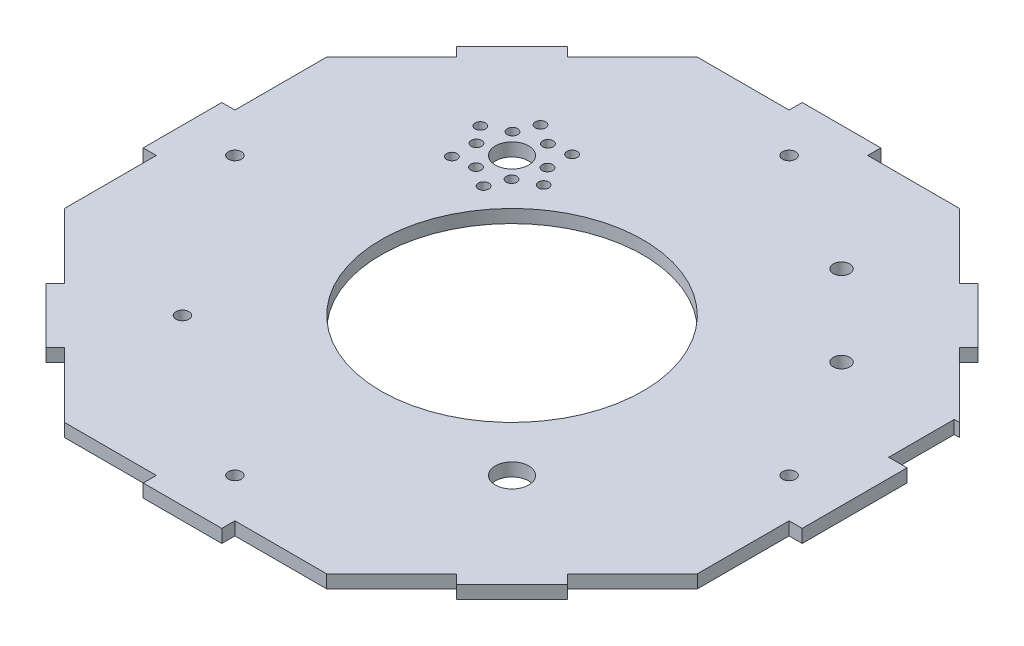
ISO-10303-21;
HEADER;
FILE_DESCRIPTION(('STEP AP214'),'2;1');
FILE_NAME('part.step','',(''),(''),'','','');
FILE_SCHEMA(('AUTOMOTIVE_DESIGN { 1 0 10303 214 1 1 1 1 }'));
ENDSEC;
DATA;
#1=APPLICATION_CONTEXT('core data for automotive mechanical design processes');
#2=APPLICATION_PROTOCOL_DEFINITION('international standard','automotive_design',2000,#1);
#3=PRODUCT_CONTEXT('',#1,'mechanical');
#4=PRODUCT('Part','Part','',(#3));
#5=PRODUCT_RELATED_PRODUCT_CATEGORY('part','',(#4));
#6=PRODUCT_DEFINITION_FORMATION('','',#4);
#7=PRODUCT_DEFINITION_CONTEXT('part definition',#1,'design');
#8=PRODUCT_DEFINITION('design','',#6,#7);
#9=PRODUCT_DEFINITION_SHAPE('','',#8);
#10=(LENGTH_UNIT() NAMED_UNIT(*) SI_UNIT(.MILLI.,.METRE.));
#11=(NAMED_UNIT(*) PLANE_ANGLE_UNIT() SI_UNIT($,.RADIAN.));
#12=(NAMED_UNIT(*) SI_UNIT($,.STERADIAN.) SOLID_ANGLE_UNIT());
#13=UNCERTAINTY_MEASURE_WITH_UNIT(LENGTH_MEASURE(1.E-05),#10,'distance_accuracy_value','');
#14=(GEOMETRIC_REPRESENTATION_CONTEXT(3) GLOBAL_UNCERTAINTY_ASSIGNED_CONTEXT((#13)) GLOBAL_UNIT_ASSIGNED_CONTEXT((#10,
#11,#12)) REPRESENTATION_CONTEXT('',''));
#15=CARTESIAN_POINT('',(0.,0.,0.));
#16=DIRECTION('',(0.,0.,1.));
#17=DIRECTION('',(1.,0.,0.));
#18=AXIS2_PLACEMENT_3D('',#15,#16,#17);
#19=CARTESIAN_POINT('',(0.,5.,0.));
#20=DIRECTION('',(0.,-1.,0.));
#21=DIRECTION('',(0.,0.,-1.));
#22=AXIS2_PLACEMENT_3D('',#19,#20,#21);
#23=PLANE('',#22);
#24=CARTESIAN_POINT('',(32.2695988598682,5.,-32.7248634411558));
#25=DIRECTION('',(0.,1.,0.));
#26=DIRECTION('',(0.,0.,1.));
#27=AXIS2_PLACEMENT_3D('',#24,#25,#26);
#28=CIRCLE('',#27,2.00000000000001);
#29=CARTESIAN_POINT('',(32.2695988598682,5.,-30.7248634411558));
#30=VERTEX_POINT('',#29);
#31=EDGE_CURVE('E574',#30,#30,#28,.T.);
#32=ORIENTED_EDGE('',*,*,#31,.F.);
#33=EDGE_LOOP('',(#32));
#34=FACE_BOUND('',#33,.T.);
#35=CARTESIAN_POINT('',(21.1575220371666,5.,-20.909047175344));
#36=DIRECTION('',(0.,1.,0.));
#37=DIRECTION('',(0.,0.,1.));
#38=AXIS2_PLACEMENT_3D('',#35,#36,#37);
#39=CIRCLE('',#38,2.00000000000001);
#40=CARTESIAN_POINT('',(21.1575220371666,5.,-18.909047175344));
#41=VERTEX_POINT('',#40);
#42=EDGE_CURVE('E564',#41,#41,#39,.T.);
#43=ORIENTED_EDGE('',*,*,#42,.F.);
#44=EDGE_LOOP('',(#43));
#45=FACE_BOUND('',#44,.T.);
#46=CARTESIAN_POINT('',(26.1673297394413,5.,-14.4319423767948));
#47=DIRECTION('',(0.,1.,0.));
#48=DIRECTION('',(0.,0.,1.));
#49=AXIS2_PLACEMENT_3D('',#46,#47,#48);
#50=CIRCLE('',#49,2.00000000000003);
#51=CARTESIAN_POINT('',(26.1673297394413,5.,-12.4319423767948));
#52=VERTEX_POINT('',#51);
#53=EDGE_CURVE('E561',#52,#52,#50,.T.);
#54=ORIENTED_EDGE('',*,*,#53,.F.);
#55=EDGE_LOOP('',(#54));
#56=FACE_BOUND('',#55,.T.);
#57=CARTESIAN_POINT('',(25.8342806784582,5.,-5.37779822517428));
#58=DIRECTION('',(0.,1.,0.));
#59=DIRECTION('',(0.,0.,1.));
#60=AXIS2_PLACEMENT_3D('',#57,#58,#59);
#61=CIRCLE('',#60,2.);
#62=CARTESIAN_POINT('',(25.8342806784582,5.,-3.37779822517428));
#63=VERTEX_POINT('',#62);
#64=EDGE_CURVE('E558',#63,#63,#61,.T.);
#65=ORIENTED_EDGE('',*,*,#64,.F.);
#66=EDGE_LOOP('',(#65));
#67=FACE_BOUND('',#66,.T.);
#68=CARTESIAN_POINT('',(33.9485218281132,5.,-6.47786656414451));
#69=DIRECTION('',(0.,1.,0.));
#70=DIRECTION('',(0.,0.,1.));
#71=AXIS2_PLACEMENT_3D('',#68,#69,#70);
#72=CIRCLE('',#71,2.00000000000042);
#73=CARTESIAN_POINT('',(33.9485218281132,5.,-4.47786656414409));
#74=VERTEX_POINT('',#73);
#75=EDGE_CURVE('E554',#74,#74,#72,.T.);
#76=ORIENTED_EDGE('',*,*,#75,.F.);
#77=EDGE_LOOP('',(#76));
#78=FACE_BOUND('',#77,.T.);
#79=CARTESIAN_POINT('',(41.6231161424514,5.,-1.66236554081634));
#80=DIRECTION('',(0.,1.,0.));
#81=DIRECTION('',(0.,0.,1.));
#82=AXIS2_PLACEMENT_3D('',#79,#80,#81);
#83=CIRCLE('',#82,2.);
#84=CARTESIAN_POINT('',(41.6231161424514,5.,0.337634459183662));
#85=VERTEX_POINT('',#84);
#86=EDGE_CURVE('E550',#85,#85,#83,.T.);
#87=ORIENTED_EDGE('',*,*,#86,.F.);
#88=EDGE_LOOP('',(#87));
#89=FACE_BOUND('',#88,.T.);
#90=CARTESIAN_POINT('',(44.7275495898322,5.,-9.23953867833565));
#91=DIRECTION('',(0.,1.,0.));
#92=DIRECTION('',(0.,0.,1.));
#93=AXIS2_PLACEMENT_3D('',#90,#91,#92);
#94=CIRCLE('',#93,1.99999999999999);
#95=CARTESIAN_POINT('',(44.7275495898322,5.,-7.23953867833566));
#96=VERTEX_POINT('',#95);
#97=EDGE_CURVE('E546',#96,#96,#94,.T.);
#98=ORIENTED_EDGE('',*,*,#97,.F.);
#99=EDGE_LOOP('',(#98));
#100=FACE_BOUND('',#99,.T.);
#101=CARTESIAN_POINT('',(52.7351929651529,5.,-13.4781818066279));
#102=DIRECTION('',(0.,1.,0.));
#103=DIRECTION('',(0.,0.,1.));
#104=AXIS2_PLACEMENT_3D('',#101,#102,#103);
#105=CIRCLE('',#104,2.);
#106=CARTESIAN_POINT('',(52.7351929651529,5.,-11.4781818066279));
#107=VERTEX_POINT('',#106);
#108=EDGE_CURVE('E542',#107,#107,#105,.T.);
#109=ORIENTED_EDGE('',*,*,#108,.F.);
#110=EDGE_LOOP('',(#109));
#111=FACE_BOUND('',#110,.T.);
#112=CARTESIAN_POINT('',(47.7253852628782,5.,-19.9552866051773));
#113=DIRECTION('',(0.,1.,0.));
#114=DIRECTION('',(0.,0.,1.));
#115=AXIS2_PLACEMENT_3D('',#112,#113,#114);
#116=CIRCLE('',#115,1.99999999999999);
#117=CARTESIAN_POINT('',(47.7253852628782,5.,-17.9552866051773));
#118=VERTEX_POINT('',#117);
#119=EDGE_CURVE('E538',#118,#118,#116,.T.);
#120=ORIENTED_EDGE('',*,*,#119,.F.);
#121=EDGE_LOOP('',(#120));
#122=FACE_BOUND('',#121,.T.);
#123=CARTESIAN_POINT('',(48.0584343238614,5.,-29.0094307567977));
#124=DIRECTION('',(0.,1.,0.));
#125=DIRECTION('',(0.,0.,1.));
#126=AXIS2_PLACEMENT_3D('',#123,#124,#125);
#127=CIRCLE('',#126,2.);
#128=CARTESIAN_POINT('',(48.0584343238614,5.,-27.0094307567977));
#129=VERTEX_POINT('',#128);
#130=EDGE_CURVE('E534',#129,#129,#127,.T.);
#131=ORIENTED_EDGE('',*,*,#130,.F.);
#132=EDGE_LOOP('',(#131));
#133=FACE_BOUND('',#132,.T.);
#134=CARTESIAN_POINT('',(39.9441931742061,5.,-27.9093624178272));
#135=DIRECTION('',(0.,1.,0.));
#136=DIRECTION('',(0.,0.,1.));
#137=AXIS2_PLACEMENT_3D('',#134,#135,#136);
#138=CIRCLE('',#137,1.99999999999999);
#139=CARTESIAN_POINT('',(39.9441931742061,5.,-25.9093624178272));
#140=VERTEX_POINT('',#139);
#141=EDGE_CURVE('E530',#140,#140,#138,.T.);
#142=ORIENTED_EDGE('',*,*,#141,.F.);
#143=EDGE_LOOP('',(#142));
#144=FACE_BOUND('',#143,.T.);
#145=CARTESIAN_POINT('',(29.1651654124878,5.,-25.1476903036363));
#146=DIRECTION('',(0.,1.,0.));
#147=DIRECTION('',(0.,0.,1.));
#148=AXIS2_PLACEMENT_3D('',#145,#146,#147);
#149=CIRCLE('',#148,1.9999999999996);
#150=CARTESIAN_POINT('',(29.1651654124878,5.,-23.1476903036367));
#151=VERTEX_POINT('',#150);
#152=EDGE_CURVE('E526',#151,#151,#149,.T.);
#153=ORIENTED_EDGE('',*,*,#152,.F.);
#154=EDGE_LOOP('',(#153));
#155=FACE_BOUND('',#154,.T.);
#156=DIRECTION('',(0.707106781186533,0.,0.707106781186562));
#157=VECTOR('',#156,1.);
#158=CARTESIAN_POINT('',(-6.16024421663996,5.,110.410461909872));
#159=LINE('',#158,#157);
#160=CARTESIAN_POINT('',(-30.908981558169,5.,85.661724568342));
#161=VERTEX_POINT('',#160);
#162=CARTESIAN_POINT('',(-6.16024421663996,5.,110.410461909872));
#163=VERTEX_POINT('',#162);
#164=EDGE_CURVE('E411',#161,#163,#159,.T.);
#165=ORIENTED_EDGE('',*,*,#164,.T.);
#166=DIRECTION('',(-0.707106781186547,0.,0.707106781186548));
#167=VECTOR('',#166,1.);
#168=CARTESIAN_POINT('',(-6.16024421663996,5.,110.410461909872));
#169=LINE('',#168,#167);
#170=CARTESIAN_POINT('',(-9.69577812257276,5.,113.945995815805));
#171=VERTEX_POINT('',#170);
#172=EDGE_CURVE('E193',#163,#171,#169,.T.);
#173=ORIENTED_EDGE('',*,*,#172,.T.);
#174=DIRECTION('',(0.707106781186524,0.,0.707106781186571));
#175=VECTOR('',#174,1.);
#176=CARTESIAN_POINT('',(11.517425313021,5.,135.1591992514));
#177=LINE('',#176,#175);
#178=CARTESIAN_POINT('',(11.517425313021,5.,135.1591992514));
#179=VERTEX_POINT('',#178);
#180=EDGE_CURVE('E655',#171,#179,#177,.T.);
#181=ORIENTED_EDGE('',*,*,#180,.T.);
#182=DIRECTION('',(0.707106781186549,0.,-0.707106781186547));
#183=VECTOR('',#182,1.);
#184=CARTESIAN_POINT('',(15.0529592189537,5.,131.623665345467));
#185=LINE('',#184,#183);
#186=CARTESIAN_POINT('',(15.0529592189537,5.,131.623665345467));
#187=VERTEX_POINT('',#186);
#188=EDGE_CURVE('E657',#179,#187,#185,.T.);
#189=ORIENTED_EDGE('',*,*,#188,.T.);
#190=DIRECTION('',(0.707106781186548,0.,0.707106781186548));
#191=VECTOR('',#190,1.);
#192=CARTESIAN_POINT('',(39.8016965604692,5.,156.372402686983));
#193=LINE('',#192,#191);
#194=CARTESIAN_POINT('',(39.8016965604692,5.,156.372402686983));
#195=VERTEX_POINT('',#194);
#196=EDGE_CURVE('E659',#187,#195,#193,.T.);
#197=ORIENTED_EDGE('',*,*,#196,.T.);
#198=DIRECTION('',(1.,0.,0.));
#199=VECTOR('',#198,1.);
#200=CARTESIAN_POINT('',(74.8016965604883,5.,156.372402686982));
#201=LINE('',#200,#199);
#202=CARTESIAN_POINT('',(74.8016965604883,5.,156.372402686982));
#203=VERTEX_POINT('',#202);
#204=EDGE_CURVE('E661',#195,#203,#201,.T.);
#205=ORIENTED_EDGE('',*,*,#204,.T.);
#206=DIRECTION('',(0.,0.,1.));
#207=VECTOR('',#206,1.);
#208=CARTESIAN_POINT('',(74.8016965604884,5.,161.372402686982));
#209=LINE('',#208,#207);
#210=CARTESIAN_POINT('',(74.8016965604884,5.,161.372402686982));
#211=VERTEX_POINT('',#210);
#212=EDGE_CURVE('E663',#203,#211,#209,.T.);
#213=ORIENTED_EDGE('',*,*,#212,.T.);
#214=DIRECTION('',(1.,0.,0.));
#215=VECTOR('',#214,1.);
#216=CARTESIAN_POINT('',(104.801696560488,5.,161.372402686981));
#217=LINE('',#216,#215);
#218=CARTESIAN_POINT('',(104.801696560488,5.,161.372402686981));
#219=VERTEX_POINT('',#218);
#220=EDGE_CURVE('E665',#211,#219,#217,.T.);
#221=ORIENTED_EDGE('',*,*,#220,.T.);
#222=DIRECTION('',(0.,0.,-1.));
#223=VECTOR('',#222,1.);
#224=CARTESIAN_POINT('',(104.801696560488,5.,156.372402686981));
#225=LINE('',#224,#223);
#226=CARTESIAN_POINT('',(104.801696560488,5.,156.372402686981));
#227=VERTEX_POINT('',#226);
#228=EDGE_CURVE('E667',#219,#227,#225,.T.);
#229=ORIENTED_EDGE('',*,*,#228,.T.);
#230=DIRECTION('',(1.,0.,0.));
#231=VECTOR('',#230,1.);
#232=CARTESIAN_POINT('',(139.801696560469,5.,156.37240268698));
#233=LINE('',#232,#231);
#234=CARTESIAN_POINT('',(139.801696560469,5.,156.37240268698));
#235=VERTEX_POINT('',#234);
#236=EDGE_CURVE('E669',#227,#235,#233,.T.);
#237=ORIENTED_EDGE('',*,*,#236,.T.);
#238=DIRECTION('',(0.707106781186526,0.,-0.707106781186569));
#239=VECTOR('',#238,1.);
#240=CARTESIAN_POINT('',(164.550433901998,5.,131.62366534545));
#241=LINE('',#240,#239);
#242=CARTESIAN_POINT('',(164.550433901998,5.,131.62366534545));
#243=VERTEX_POINT('',#242);
#244=EDGE_CURVE('E671',#235,#243,#241,.T.);
#245=ORIENTED_EDGE('',*,*,#244,.T.);
#246=DIRECTION('',(0.70710678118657,0.,0.707106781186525));
#247=VECTOR('',#246,1.);
#248=CARTESIAN_POINT('',(164.550433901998,5.,131.62366534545));
#249=LINE('',#248,#247);
#250=CARTESIAN_POINT('',(168.085967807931,5.,135.159199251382));
#251=VERTEX_POINT('',#250);
#252=EDGE_CURVE('E673',#243,#251,#249,.T.);
#253=ORIENTED_EDGE('',*,*,#252,.T.);
#254=DIRECTION('',(0.707106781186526,0.,-0.707106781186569));
#255=VECTOR('',#254,1.);
#256=CARTESIAN_POINT('',(189.299171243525,5.,113.945995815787));
#257=LINE('',#256,#255);
#258=CARTESIAN_POINT('',(189.299171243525,5.,113.945995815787));
#259=VERTEX_POINT('',#258);
#260=EDGE_CURVE('E675',#251,#259,#257,.T.);
#261=ORIENTED_EDGE('',*,*,#260,.T.);
#262=DIRECTION('',(-0.70710678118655,0.,-0.707106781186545));
#263=VECTOR('',#262,1.);
#264=CARTESIAN_POINT('',(189.299171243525,5.,113.945995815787));
#265=LINE('',#264,#263);
#266=CARTESIAN_POINT('',(185.763637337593,5.,110.410461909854));
#267=VERTEX_POINT('',#266);
#268=EDGE_CURVE('E677',#259,#267,#265,.T.);
#269=ORIENTED_EDGE('',*,*,#268,.T.);
#270=DIRECTION('',(0.707106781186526,0.,-0.707106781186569));
#271=VECTOR('',#270,1.);
#272=CARTESIAN_POINT('',(210.512374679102,5.,85.6617245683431));
#273=LINE('',#272,#271);
#274=CARTESIAN_POINT('',(210.512374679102,5.,85.6617245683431));
#275=VERTEX_POINT('',#274);
#276=EDGE_CURVE('E679',#267,#275,#273,.T.);
#277=ORIENTED_EDGE('',*,*,#276,.T.);
#278=DIRECTION('',(0.,0.,-1.));
#279=VECTOR('',#278,1.);
#280=CARTESIAN_POINT('',(210.512374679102,5.,50.6617245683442));
#281=LINE('',#280,#279);
#282=CARTESIAN_POINT('',(210.512374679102,5.,50.6617245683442));
#283=VERTEX_POINT('',#282);
#284=EDGE_CURVE('E681',#275,#283,#281,.T.);
#285=ORIENTED_EDGE('',*,*,#284,.T.);
#286=DIRECTION('',(1.,0.,0.));
#287=VECTOR('',#286,1.);
#288=CARTESIAN_POINT('',(210.512374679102,5.,50.6617245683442));
#289=LINE('',#288,#287);
#290=CARTESIAN_POINT('',(215.512374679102,5.,50.6617245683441));
#291=VERTEX_POINT('',#290);
#292=EDGE_CURVE('E683',#283,#291,#289,.T.);
#293=ORIENTED_EDGE('',*,*,#292,.T.);
#294=DIRECTION('',(0.,0.,-1.));
#295=VECTOR('',#294,1.);
#296=CARTESIAN_POINT('',(215.512374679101,5.,10.661724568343));
#297=LINE('',#296,#295);
#298=CARTESIAN_POINT('',(215.512374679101,5.,10.661724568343));
#299=VERTEX_POINT('',#298);
#300=EDGE_CURVE('E685',#291,#299,#297,.T.);
#301=ORIENTED_EDGE('',*,*,#300,.T.);
#302=DIRECTION('',(-1.,0.,0.));
#303=VECTOR('',#302,1.);
#304=CARTESIAN_POINT('',(210.512374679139,5.,10.6617245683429));
#305=LINE('',#304,#303);
#306=CARTESIAN_POINT('',(208.512374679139,5.,10.6617245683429));
#307=VERTEX_POINT('',#306);
#308=EDGE_CURVE('E687',#299,#307,#305,.T.);
#309=ORIENTED_EDGE('',*,*,#308,.T.);
#310=DIRECTION('',(0.,0.,-1.));
#311=VECTOR('',#310,1.);
#312=CARTESIAN_POINT('',(208.512374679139,5.,10.6617245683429));
#313=LINE('',#312,#311);
#314=CARTESIAN_POINT('',(208.512374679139,5.,-14.3382754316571));
#315=VERTEX_POINT('',#314);
#316=EDGE_CURVE('E689',#307,#315,#313,.T.);
#317=ORIENTED_EDGE('',*,*,#316,.T.);
#318=DIRECTION('',(1.,0.,-5.08273978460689E-13));
#319=VECTOR('',#318,1.);
#320=CARTESIAN_POINT('',(208.512374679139,5.,-14.3382754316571));
#321=LINE('',#320,#319);
#322=CARTESIAN_POINT('',(210.512374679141,5.,-14.3382754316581));
#323=VERTEX_POINT('',#322);
#324=EDGE_CURVE('E691',#315,#323,#321,.T.);
#325=ORIENTED_EDGE('',*,*,#324,.T.);
#326=DIRECTION('',(-0.707106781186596,0.,-0.707106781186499));
#327=VECTOR('',#326,1.);
#328=CARTESIAN_POINT('',(185.763637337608,5.,-39.0870127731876));
#329=LINE('',#328,#327);
#330=CARTESIAN_POINT('',(185.763637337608,5.,-39.0870127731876));
#331=VERTEX_POINT('',#330);
#332=EDGE_CURVE('E693',#323,#331,#329,.T.);
#333=ORIENTED_EDGE('',*,*,#332,.T.);
#334=DIRECTION('',(0.707106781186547,0.,-0.707106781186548));
#335=VECTOR('',#334,1.);
#336=CARTESIAN_POINT('',(189.299171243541,5.,-42.6225466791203));
#337=LINE('',#336,#335);
#338=CARTESIAN_POINT('',(189.299171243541,5.,-42.6225466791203));
#339=VERTEX_POINT('',#338);
#340=EDGE_CURVE('E695',#331,#339,#337,.T.);
#341=ORIENTED_EDGE('',*,*,#340,.T.);
#342=DIRECTION('',(-0.707106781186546,0.,-0.707106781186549));
#343=VECTOR('',#342,1.);
#344=CARTESIAN_POINT('',(168.085967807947,5.,-63.8357501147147));
#345=LINE('',#344,#343);
#346=CARTESIAN_POINT('',(168.085967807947,5.,-63.8357501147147));
#347=VERTEX_POINT('',#346);
#348=EDGE_CURVE('E697',#339,#347,#345,.T.);
#349=ORIENTED_EDGE('',*,*,#348,.T.);
#350=DIRECTION('',(-0.707106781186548,0.,0.707106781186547));
#351=VECTOR('',#350,1.);
#352=CARTESIAN_POINT('',(168.085967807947,5.,-63.8357501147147));
#353=LINE('',#352,#351);
#354=CARTESIAN_POINT('',(164.550433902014,5.,-60.300216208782));
#355=VERTEX_POINT('',#354);
#356=EDGE_CURVE('E699',#347,#355,#353,.T.);
#357=ORIENTED_EDGE('',*,*,#356,.T.);
#358=DIRECTION('',(-0.707106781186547,0.,-0.707106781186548));
#359=VECTOR('',#358,1.);
#360=CARTESIAN_POINT('',(139.801696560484,5.,-85.0489535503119));
#361=LINE('',#360,#359);
#362=CARTESIAN_POINT('',(139.801696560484,5.,-85.0489535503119));
#363=VERTEX_POINT('',#362);
#364=EDGE_CURVE('E701',#355,#363,#361,.T.);
#365=ORIENTED_EDGE('',*,*,#364,.T.);
#366=DIRECTION('',(-1.,0.,0.));
#367=VECTOR('',#366,1.);
#368=CARTESIAN_POINT('',(104.801696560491,5.,-85.0489535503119));
#369=LINE('',#368,#367);
#370=CARTESIAN_POINT('',(104.801696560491,5.,-85.0489535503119));
#371=VERTEX_POINT('',#370);
#372=EDGE_CURVE('E703',#363,#371,#369,.T.);
#373=ORIENTED_EDGE('',*,*,#372,.T.);
#374=DIRECTION('',(0.,0.,-1.));
#375=VECTOR('',#374,1.);
#376=CARTESIAN_POINT('',(104.801696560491,5.,-90.0489535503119));
#377=LINE('',#376,#375);
#378=CARTESIAN_POINT('',(104.801696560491,5.,-90.0489535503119));
#379=VERTEX_POINT('',#378);
#380=EDGE_CURVE('E705',#371,#379,#377,.T.);
#381=ORIENTED_EDGE('',*,*,#380,.T.);
#382=DIRECTION('',(-1.,0.,0.));
#383=VECTOR('',#382,1.);
#384=CARTESIAN_POINT('',(74.8016965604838,5.,-90.0489535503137));
#385=LINE('',#384,#383);
#386=CARTESIAN_POINT('',(74.8016965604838,5.,-90.0489535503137));
#387=VERTEX_POINT('',#386);
#388=EDGE_CURVE('E707',#379,#387,#385,.T.);
#389=ORIENTED_EDGE('',*,*,#388,.T.);
#390=DIRECTION('',(0.,0.,1.));
#391=VECTOR('',#390,1.);
#392=CARTESIAN_POINT('',(74.8016965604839,5.,-85.0489535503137));
#393=LINE('',#392,#391);
#394=CARTESIAN_POINT('',(74.8016965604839,5.,-85.0489535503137));
#395=VERTEX_POINT('',#394);
#396=EDGE_CURVE('E709',#387,#395,#393,.T.);
#397=ORIENTED_EDGE('',*,*,#396,.T.);
#398=DIRECTION('',(-1.,0.,0.));
#399=VECTOR('',#398,1.);
#400=CARTESIAN_POINT('',(39.8016965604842,5.,-85.0489535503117));
#401=LINE('',#400,#399);
#402=CARTESIAN_POINT('',(39.8016965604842,5.,-85.0489535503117));
#403=VERTEX_POINT('',#402);
#404=EDGE_CURVE('E711',#395,#403,#401,.T.);
#405=ORIENTED_EDGE('',*,*,#404,.T.);
#406=DIRECTION('',(-0.707106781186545,0.,0.70710678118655));
#407=VECTOR('',#406,1.);
#408=CARTESIAN_POINT('',(15.052959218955,5.,-60.3002162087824));
#409=LINE('',#408,#407);
#410=CARTESIAN_POINT('',(15.052959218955,5.,-60.3002162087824));
#411=VERTEX_POINT('',#410);
#412=EDGE_CURVE('E713',#403,#411,#409,.T.);
#413=ORIENTED_EDGE('',*,*,#412,.T.);
#414=DIRECTION('',(-0.70710678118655,0.,-0.707106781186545));
#415=VECTOR('',#414,1.);
#416=CARTESIAN_POINT('',(15.052959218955,5.,-60.3002162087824));
#417=LINE('',#416,#415);
#418=CARTESIAN_POINT('',(11.5174253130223,5.,-63.8357501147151));
#419=VERTEX_POINT('',#418);
#420=EDGE_CURVE('E715',#411,#419,#417,.T.);
#421=ORIENTED_EDGE('',*,*,#420,.T.);
#422=DIRECTION('',(-0.707106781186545,0.,0.70710678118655));
#423=VECTOR('',#422,1.);
#424=CARTESIAN_POINT('',(-9.69577812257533,5.,-42.6225466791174));
#425=LINE('',#424,#423);
#426=CARTESIAN_POINT('',(-9.69577812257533,5.,-42.6225466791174));
#427=VERTEX_POINT('',#426);
#428=EDGE_CURVE('E717',#419,#427,#425,.T.);
#429=ORIENTED_EDGE('',*,*,#428,.T.);
#430=DIRECTION('',(0.70710678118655,0.,0.707106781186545));
#431=VECTOR('',#430,1.);
#432=CARTESIAN_POINT('',(-9.69577812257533,5.,-42.6225466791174));
#433=LINE('',#432,#431);
#434=CARTESIAN_POINT('',(-6.16024421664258,5.,-39.0870127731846));
#435=VERTEX_POINT('',#434);
#436=EDGE_CURVE('E719',#427,#435,#433,.T.);
#437=ORIENTED_EDGE('',*,*,#436,.T.);
#438=DIRECTION('',(-0.707106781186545,0.,0.70710678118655));
#439=VECTOR('',#438,1.);
#440=CARTESIAN_POINT('',(-30.908981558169,5.,-14.3382754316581));
#441=LINE('',#440,#439);
#442=CARTESIAN_POINT('',(-30.908981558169,5.,-14.3382754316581));
#443=VERTEX_POINT('',#442);
#444=EDGE_CURVE('E721',#435,#443,#441,.T.);
#445=ORIENTED_EDGE('',*,*,#444,.T.);
#446=DIRECTION('',(0.,0.,1.));
#447=VECTOR('',#446,1.);
#448=CARTESIAN_POINT('',(-30.9089815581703,5.,20.6617245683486));
#449=LINE('',#448,#447);
#450=CARTESIAN_POINT('',(-30.9089815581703,5.,20.6617245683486));
#451=VERTEX_POINT('',#450);
#452=EDGE_CURVE('E723',#443,#451,#449,.T.);
#453=ORIENTED_EDGE('',*,*,#452,.T.);
#454=DIRECTION('',(-1.,0.,0.));
#455=VECTOR('',#454,1.);
#456=CARTESIAN_POINT('',(-35.9089815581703,5.,20.6617245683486));
#457=LINE('',#456,#455);
#458=CARTESIAN_POINT('',(-35.9089815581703,5.,20.6617245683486));
#459=VERTEX_POINT('',#458);
#460=EDGE_CURVE('E311',#451,#459,#457,.T.);
#461=ORIENTED_EDGE('',*,*,#460,.T.);
#462=DIRECTION('',(0.,0.,1.));
#463=VECTOR('',#462,1.);
#464=CARTESIAN_POINT('',(-35.9089815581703,5.,50.6617245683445));
#465=LINE('',#464,#463);
#466=CARTESIAN_POINT('',(-35.9089815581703,5.,50.6617245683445));
#467=VERTEX_POINT('',#466);
#468=EDGE_CURVE('E305',#459,#467,#465,.T.);
#469=ORIENTED_EDGE('',*,*,#468,.T.);
#470=DIRECTION('',(1.,0.,0.));
#471=VECTOR('',#470,1.);
#472=CARTESIAN_POINT('',(-35.9089815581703,5.,50.6617245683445));
#473=LINE('',#472,#471);
#474=CARTESIAN_POINT('',(-30.9089815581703,5.,50.6617245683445));
#475=VERTEX_POINT('',#474);
#476=EDGE_CURVE('E309',#467,#475,#473,.T.);
#477=ORIENTED_EDGE('',*,*,#476,.T.);
#478=DIRECTION('',(0.,0.,1.));
#479=VECTOR('',#478,1.);
#480=CARTESIAN_POINT('',(-30.908981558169,5.,85.661724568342));
#481=LINE('',#480,#479);
#482=EDGE_CURVE('E51',#475,#161,#481,.T.);
#483=ORIENTED_EDGE('',*,*,#482,.T.);
#484=EDGE_LOOP('',(#165,#173,#181,#189,#197,#205,#213,#221,#229,#237,#245,#253,#261,#269,#277,
#285,#293,#301,#309,#317,#325,#333,#341,#349,#357,#365,#373,#381,#389,#397,#405,#413,#421,#429,
#437,#445,#453,#461,#469,#477,#483));
#485=FACE_BOUND('',#484,.T.);
#486=CARTESIAN_POINT('',(89.8016965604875,5.,35.6617245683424));
#487=DIRECTION('',(0.,1.,0.));
#488=DIRECTION('',(0.,0.,1.));
#489=AXIS2_PLACEMENT_3D('',#486,#487,#488);
#490=CIRCLE('',#489,50.);
#491=CARTESIAN_POINT('',(89.8016965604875,5.,85.6617245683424));
#492=VERTEX_POINT('',#491);
#493=EDGE_CURVE('E333',#492,#492,#490,.T.);
#494=ORIENTED_EDGE('',*,*,#493,.F.);
#495=EDGE_LOOP('',(#494));
#496=FACE_BOUND('',#495,.T.);
#497=CARTESIAN_POINT('',(142.657035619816,5.,88.5170636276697));
#498=DIRECTION('',(0.,1.,0.));
#499=DIRECTION('',(0.,0.,-1.));
#500=AXIS2_PLACEMENT_3D('',#497,#498,#499);
#501=CIRCLE('',#500,6.35000000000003);
#502=CARTESIAN_POINT('',(142.657035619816,5.,82.1670636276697));
#503=VERTEX_POINT('',#502);
#504=EDGE_CURVE('E643',#503,#503,#501,.T.);
#505=ORIENTED_EDGE('',*,*,#504,.F.);
#506=EDGE_LOOP('',(#505));
#507=FACE_BOUND('',#506,.T.);
#508=CARTESIAN_POINT('',(89.8016965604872,5.,141.372402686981));
#509=DIRECTION('',(0.,1.,0.));
#510=DIRECTION('',(0.,0.,1.));
#511=AXIS2_PLACEMENT_3D('',#508,#509,#510);
#512=CIRCLE('',#511,2.49999999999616);
#513=CARTESIAN_POINT('',(89.8016965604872,5.,143.872402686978));
#514=VERTEX_POINT('',#513);
#515=EDGE_CURVE('E637',#514,#514,#512,.T.);
#516=ORIENTED_EDGE('',*,*,#515,.F.);
#517=EDGE_LOOP('',(#516));
#518=FACE_BOUND('',#517,.T.);
#519=CARTESIAN_POINT('',(89.8016965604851,5.,-70.0489535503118));
#520=DIRECTION('',(0.,1.,0.));
#521=DIRECTION('',(0.,0.,1.));
#522=AXIS2_PLACEMENT_3D('',#519,#520,#521);
#523=CIRCLE('',#522,2.50000000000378);
#524=CARTESIAN_POINT('',(89.8016965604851,5.,-67.548953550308));
#525=VERTEX_POINT('',#524);
#526=EDGE_CURVE('E631',#525,#525,#523,.T.);
#527=ORIENTED_EDGE('',*,*,#526,.F.);
#528=EDGE_LOOP('',(#527));
#529=FACE_BOUND('',#528,.T.);
#530=CARTESIAN_POINT('',(-15.9089815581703,5.,35.6617245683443));
#531=DIRECTION('',(0.,1.,0.));
#532=DIRECTION('',(0.,0.,1.));
#533=AXIS2_PLACEMENT_3D('',#530,#531,#532);
#534=CIRCLE('',#533,2.50000000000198);
#535=CARTESIAN_POINT('',(-15.9089815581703,5.,38.1617245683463));
#536=VERTEX_POINT('',#535);
#537=EDGE_CURVE('E625',#536,#536,#534,.T.);
#538=ORIENTED_EDGE('',*,*,#537,.F.);
#539=EDGE_LOOP('',(#538));
#540=FACE_BOUND('',#539,.T.);
#541=CARTESIAN_POINT('',(195.512374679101,5.,35.6617245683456));
#542=DIRECTION('',(0.,1.,0.));
#543=DIRECTION('',(0.,0.,1.));
#544=AXIS2_PLACEMENT_3D('',#541,#542,#543);
#545=CIRCLE('',#544,2.50000000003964);
#546=CARTESIAN_POINT('',(195.512374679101,5.,38.1617245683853));
#547=VERTEX_POINT('',#546);
#548=EDGE_CURVE('E619',#547,#547,#545,.T.);
#549=ORIENTED_EDGE('',*,*,#548,.F.);
#550=EDGE_LOOP('',(#549));
#551=FACE_BOUND('',#550,.T.);
#552=CARTESIAN_POINT('',(26.9463575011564,5.,98.5170636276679));
#553=DIRECTION('',(0.,1.,0.));
#554=DIRECTION('',(0.,0.,1.));
#555=AXIS2_PLACEMENT_3D('',#552,#553,#554);
#556=CIRCLE('',#555,2.50000000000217);
#557=CARTESIAN_POINT('',(26.9463575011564,5.,101.01706362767));
#558=VERTEX_POINT('',#557);
#559=EDGE_CURVE('E613',#558,#558,#556,.T.);
#560=ORIENTED_EDGE('',*,*,#559,.F.);
#561=EDGE_LOOP('',(#560));
#562=FACE_BOUND('',#561,.T.);
#563=CARTESIAN_POINT('',(137.228103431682,5.,-42.6225466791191));
#564=DIRECTION('',(0.,1.,0.));
#565=DIRECTION('',(0.,0.,1.));
#566=AXIS2_PLACEMENT_3D('',#563,#564,#565);
#567=CIRCLE('',#566,3.175);
#568=CARTESIAN_POINT('',(137.228103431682,5.,-39.4475466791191));
#569=VERTEX_POINT('',#568);
#570=EDGE_CURVE('E607',#569,#569,#567,.T.);
#571=ORIENTED_EDGE('',*,*,#570,.F.);
#572=EDGE_LOOP('',(#571));
#573=FACE_BOUND('',#572,.T.);
#574=CARTESIAN_POINT('',(36.9463575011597,5.,-17.1936144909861));
#575=DIRECTION('',(0.,1.,0.));
#576=DIRECTION('',(0.,0.,1.));
#577=AXIS2_PLACEMENT_3D('',#574,#575,#576);
#578=CIRCLE('',#577,6.35);
#579=CARTESIAN_POINT('',(36.9463575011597,5.,-10.8436144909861));
#580=VERTEX_POINT('',#579);
#581=EDGE_CURVE('E601',#580,#580,#578,.T.);
#582=ORIENTED_EDGE('',*,*,#581,.F.);
#583=EDGE_LOOP('',(#582));
#584=FACE_BOUND('',#583,.T.);
#585=CARTESIAN_POINT('',(168.085967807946,5.,-11.764682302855));
#586=DIRECTION('',(0.,1.,0.));
#587=DIRECTION('',(0.,0.,-1.));
#588=AXIS2_PLACEMENT_3D('',#585,#586,#587);
#589=CIRCLE('',#588,3.17499999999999);
#590=CARTESIAN_POINT('',(168.085967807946,5.,-14.939682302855));
#591=VERTEX_POINT('',#590);
#592=EDGE_CURVE('E595',#591,#591,#589,.T.);
#593=ORIENTED_EDGE('',*,*,#592,.F.);
#594=EDGE_LOOP('',(#593));
#595=FACE_BOUND('',#594,.T.);
#596=ADVANCED_FACE('F32',(#34,#45,#56,#67,#78,#89,#100,#111,#122,#133,#144,#155,#485,#496,#507,
#518,#529,#540,#551,#562,#573,#584,#595),#23,.F.);
#597=CARTESIAN_POINT('',(0.,0.,0.));
#598=DIRECTION('',(0.,-1.,0.));
#599=DIRECTION('',(0.,0.,-1.));
#600=AXIS2_PLACEMENT_3D('',#597,#598,#599);
#601=PLANE('',#600);
#602=CARTESIAN_POINT('',(32.2695988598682,0.,-32.7248634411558));
#603=DIRECTION('',(0.,-1.,0.));
#604=DIRECTION('',(0.,0.,-1.));
#605=AXIS2_PLACEMENT_3D('',#602,#603,#604);
#606=CIRCLE('',#605,2.00000000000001);
#607=CARTESIAN_POINT('',(32.2695988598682,0.,-34.7248634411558));
#608=VERTEX_POINT('',#607);
#609=EDGE_CURVE('E36',#608,#608,#606,.T.);
#610=ORIENTED_EDGE('',*,*,#609,.F.);
#611=EDGE_LOOP('',(#610));
#612=FACE_BOUND('',#611,.T.);
#613=CARTESIAN_POINT('',(21.1575220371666,0.,-20.909047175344));
#614=DIRECTION('',(0.,-1.,0.));
#615=DIRECTION('',(0.,0.,-1.));
#616=AXIS2_PLACEMENT_3D('',#613,#614,#615);
#617=CIRCLE('',#616,2.00000000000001);
#618=CARTESIAN_POINT('',(21.1575220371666,0.,-22.909047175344));
#619=VERTEX_POINT('',#618);
#620=EDGE_CURVE('E562',#619,#619,#617,.T.);
#621=ORIENTED_EDGE('',*,*,#620,.F.);
#622=EDGE_LOOP('',(#621));
#623=FACE_BOUND('',#622,.T.);
#624=CARTESIAN_POINT('',(26.1673297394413,0.,-14.4319423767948));
#625=DIRECTION('',(0.,-1.,0.));
#626=DIRECTION('',(0.,0.,-1.));
#627=AXIS2_PLACEMENT_3D('',#624,#625,#626);
#628=CIRCLE('',#627,2.00000000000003);
#629=CARTESIAN_POINT('',(26.1673297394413,0.,-16.4319423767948));
#630=VERTEX_POINT('',#629);
#631=EDGE_CURVE('E559',#630,#630,#628,.T.);
#632=ORIENTED_EDGE('',*,*,#631,.F.);
#633=EDGE_LOOP('',(#632));
#634=FACE_BOUND('',#633,.T.);
#635=CARTESIAN_POINT('',(25.8342806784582,0.,-5.37779822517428));
#636=DIRECTION('',(0.,-1.,0.));
#637=DIRECTION('',(0.,0.,-1.));
#638=AXIS2_PLACEMENT_3D('',#635,#636,#637);
#639=CIRCLE('',#638,2.);
#640=CARTESIAN_POINT('',(25.8342806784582,0.,-7.37779822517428));
#641=VERTEX_POINT('',#640);
#642=EDGE_CURVE('E555',#641,#641,#639,.T.);
#643=ORIENTED_EDGE('',*,*,#642,.F.);
#644=EDGE_LOOP('',(#643));
#645=FACE_BOUND('',#644,.T.);
#646=CARTESIAN_POINT('',(33.9485218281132,0.,-6.47786656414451));
#647=DIRECTION('',(0.,-1.,0.));
#648=DIRECTION('',(0.,0.,-1.));
#649=AXIS2_PLACEMENT_3D('',#646,#647,#648);
#650=CIRCLE('',#649,2.00000000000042);
#651=CARTESIAN_POINT('',(33.9485218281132,0.,-8.47786656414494));
#652=VERTEX_POINT('',#651);
#653=EDGE_CURVE('E551',#652,#652,#650,.T.);
#654=ORIENTED_EDGE('',*,*,#653,.F.);
#655=EDGE_LOOP('',(#654));
#656=FACE_BOUND('',#655,.T.);
#657=CARTESIAN_POINT('',(41.6231161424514,0.,-1.66236554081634));
#658=DIRECTION('',(0.,-1.,0.));
#659=DIRECTION('',(0.,0.,-1.));
#660=AXIS2_PLACEMENT_3D('',#657,#658,#659);
#661=CIRCLE('',#660,2.);
#662=CARTESIAN_POINT('',(41.6231161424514,0.,-3.66236554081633));
#663=VERTEX_POINT('',#662);
#664=EDGE_CURVE('E547',#663,#663,#661,.T.);
#665=ORIENTED_EDGE('',*,*,#664,.F.);
#666=EDGE_LOOP('',(#665));
#667=FACE_BOUND('',#666,.T.);
#668=CARTESIAN_POINT('',(44.7275495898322,0.,-9.23953867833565));
#669=DIRECTION('',(0.,-1.,0.));
#670=DIRECTION('',(0.,0.,-1.));
#671=AXIS2_PLACEMENT_3D('',#668,#669,#670);
#672=CIRCLE('',#671,1.99999999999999);
#673=CARTESIAN_POINT('',(44.7275495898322,0.,-11.2395386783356));
#674=VERTEX_POINT('',#673);
#675=EDGE_CURVE('E543',#674,#674,#672,.T.);
#676=ORIENTED_EDGE('',*,*,#675,.F.);
#677=EDGE_LOOP('',(#676));
#678=FACE_BOUND('',#677,.T.);
#679=CARTESIAN_POINT('',(52.7351929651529,0.,-13.4781818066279));
#680=DIRECTION('',(0.,-1.,0.));
#681=DIRECTION('',(0.,0.,-1.));
#682=AXIS2_PLACEMENT_3D('',#679,#680,#681);
#683=CIRCLE('',#682,2.);
#684=CARTESIAN_POINT('',(52.7351929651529,0.,-15.4781818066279));
#685=VERTEX_POINT('',#684);
#686=EDGE_CURVE('E539',#685,#685,#683,.T.);
#687=ORIENTED_EDGE('',*,*,#686,.F.);
#688=EDGE_LOOP('',(#687));
#689=FACE_BOUND('',#688,.T.);
#690=CARTESIAN_POINT('',(47.7253852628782,0.,-19.9552866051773));
#691=DIRECTION('',(0.,-1.,0.));
#692=DIRECTION('',(0.,0.,-1.));
#693=AXIS2_PLACEMENT_3D('',#690,#691,#692);
#694=CIRCLE('',#693,1.99999999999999);
#695=CARTESIAN_POINT('',(47.7253852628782,0.,-21.9552866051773));
#696=VERTEX_POINT('',#695);
#697=EDGE_CURVE('E535',#696,#696,#694,.T.);
#698=ORIENTED_EDGE('',*,*,#697,.F.);
#699=EDGE_LOOP('',(#698));
#700=FACE_BOUND('',#699,.T.);
#701=CARTESIAN_POINT('',(48.0584343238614,0.,-29.0094307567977));
#702=DIRECTION('',(0.,-1.,0.));
#703=DIRECTION('',(0.,0.,-1.));
#704=AXIS2_PLACEMENT_3D('',#701,#702,#703);
#705=CIRCLE('',#704,2.);
#706=CARTESIAN_POINT('',(48.0584343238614,0.,-31.0094307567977));
#707=VERTEX_POINT('',#706);
#708=EDGE_CURVE('E531',#707,#707,#705,.T.);
#709=ORIENTED_EDGE('',*,*,#708,.F.);
#710=EDGE_LOOP('',(#709));
#711=FACE_BOUND('',#710,.T.);
#712=CARTESIAN_POINT('',(39.9441931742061,0.,-27.9093624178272));
#713=DIRECTION('',(0.,-1.,0.));
#714=DIRECTION('',(0.,0.,-1.));
#715=AXIS2_PLACEMENT_3D('',#712,#713,#714);
#716=CIRCLE('',#715,1.99999999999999);
#717=CARTESIAN_POINT('',(39.9441931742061,0.,-29.9093624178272));
#718=VERTEX_POINT('',#717);
#719=EDGE_CURVE('E527',#718,#718,#716,.T.);
#720=ORIENTED_EDGE('',*,*,#719,.F.);
#721=EDGE_LOOP('',(#720));
#722=FACE_BOUND('',#721,.T.);
#723=CARTESIAN_POINT('',(29.1651654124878,0.,-25.1476903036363));
#724=DIRECTION('',(0.,-1.,0.));
#725=DIRECTION('',(0.,0.,-1.));
#726=AXIS2_PLACEMENT_3D('',#723,#724,#725);
#727=CIRCLE('',#726,1.9999999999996);
#728=CARTESIAN_POINT('',(29.1651654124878,0.,-27.1476903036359));
#729=VERTEX_POINT('',#728);
#730=EDGE_CURVE('E522',#729,#729,#727,.T.);
#731=ORIENTED_EDGE('',*,*,#730,.F.);
#732=EDGE_LOOP('',(#731));
#733=FACE_BOUND('',#732,.T.);
#734=CARTESIAN_POINT('',(36.9463575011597,0.,-17.1936144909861));
#735=DIRECTION('',(0.,1.,0.));
#736=DIRECTION('',(0.,0.,1.));
#737=AXIS2_PLACEMENT_3D('',#734,#735,#736);
#738=CIRCLE('',#737,6.35);
#739=CARTESIAN_POINT('',(36.9463575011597,0.,-10.8436144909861));
#740=VERTEX_POINT('',#739);
#741=EDGE_CURVE('E598',#740,#740,#738,.T.);
#742=ORIENTED_EDGE('',*,*,#741,.T.);
#743=EDGE_LOOP('',(#742));
#744=FACE_BOUND('',#743,.T.);
#745=CARTESIAN_POINT('',(26.9463575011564,0.,98.5170636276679));
#746=DIRECTION('',(0.,1.,0.));
#747=DIRECTION('',(0.,0.,1.));
#748=AXIS2_PLACEMENT_3D('',#745,#746,#747);
#749=CIRCLE('',#748,2.50000000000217);
#750=CARTESIAN_POINT('',(26.9463575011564,0.,101.01706362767));
#751=VERTEX_POINT('',#750);
#752=EDGE_CURVE('E610',#751,#751,#749,.T.);
#753=ORIENTED_EDGE('',*,*,#752,.T.);
#754=EDGE_LOOP('',(#753));
#755=FACE_BOUND('',#754,.T.);
#756=CARTESIAN_POINT('',(-15.9089815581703,0.,35.6617245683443));
#757=DIRECTION('',(0.,1.,0.));
#758=DIRECTION('',(0.,0.,1.));
#759=AXIS2_PLACEMENT_3D('',#756,#757,#758);
#760=CIRCLE('',#759,2.50000000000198);
#761=CARTESIAN_POINT('',(-15.9089815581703,0.,38.1617245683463));
#762=VERTEX_POINT('',#761);
#763=EDGE_CURVE('E622',#762,#762,#760,.T.);
#764=ORIENTED_EDGE('',*,*,#763,.T.);
#765=EDGE_LOOP('',(#764));
#766=FACE_BOUND('',#765,.T.);
#767=CARTESIAN_POINT('',(89.8016965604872,0.,141.372402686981));
#768=DIRECTION('',(0.,1.,0.));
#769=DIRECTION('',(0.,0.,1.));
#770=AXIS2_PLACEMENT_3D('',#767,#768,#769);
#771=CIRCLE('',#770,2.49999999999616);
#772=CARTESIAN_POINT('',(89.8016965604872,0.,143.872402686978));
#773=VERTEX_POINT('',#772);
#774=EDGE_CURVE('E634',#773,#773,#771,.T.);
#775=ORIENTED_EDGE('',*,*,#774,.T.);
#776=EDGE_LOOP('',(#775));
#777=FACE_BOUND('',#776,.T.);
#778=CARTESIAN_POINT('',(89.8016965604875,0.,35.6617245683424));
#779=DIRECTION('',(0.,1.,0.));
#780=DIRECTION('',(0.,0.,1.));
#781=AXIS2_PLACEMENT_3D('',#778,#779,#780);
#782=CIRCLE('',#781,50.);
#783=CARTESIAN_POINT('',(89.8016965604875,0.,85.6617245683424));
#784=VERTEX_POINT('',#783);
#785=EDGE_CURVE('E646',#784,#784,#782,.T.);
#786=ORIENTED_EDGE('',*,*,#785,.T.);
#787=EDGE_LOOP('',(#786));
#788=FACE_BOUND('',#787,.T.);
#789=DIRECTION('',(0.707106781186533,0.,0.707106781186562));
#790=VECTOR('',#789,1.);
#791=CARTESIAN_POINT('',(-6.16024421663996,0.,110.410461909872));
#792=LINE('',#791,#790);
#793=CARTESIAN_POINT('',(-30.908981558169,0.,85.661724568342));
#794=VERTEX_POINT('',#793);
#795=CARTESIAN_POINT('',(-6.16024421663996,0.,110.410461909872));
#796=VERTEX_POINT('',#795);
#797=EDGE_CURVE('E329',#794,#796,#792,.T.);
#798=ORIENTED_EDGE('',*,*,#797,.F.);
#799=DIRECTION('',(0.,0.,1.));
#800=VECTOR('',#799,1.);
#801=CARTESIAN_POINT('',(-30.908981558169,0.,85.661724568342));
#802=LINE('',#801,#800);
#803=CARTESIAN_POINT('',(-30.9089815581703,0.,50.6617245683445));
#804=VERTEX_POINT('',#803);
#805=EDGE_CURVE('E185',#804,#794,#802,.T.);
#806=ORIENTED_EDGE('',*,*,#805,.F.);
#807=DIRECTION('',(1.,0.,0.));
#808=VECTOR('',#807,1.);
#809=CARTESIAN_POINT('',(-35.9089815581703,0.,50.6617245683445));
#810=LINE('',#809,#808);
#811=CARTESIAN_POINT('',(-35.9089815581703,0.,50.6617245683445));
#812=VERTEX_POINT('',#811);
#813=EDGE_CURVE('E179',#812,#804,#810,.T.);
#814=ORIENTED_EDGE('',*,*,#813,.F.);
#815=DIRECTION('',(0.,0.,1.));
#816=VECTOR('',#815,1.);
#817=CARTESIAN_POINT('',(-35.9089815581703,0.,50.6617245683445));
#818=LINE('',#817,#816);
#819=CARTESIAN_POINT('',(-35.9089815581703,0.,20.6617245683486));
#820=VERTEX_POINT('',#819);
#821=EDGE_CURVE('E319',#820,#812,#818,.T.);
#822=ORIENTED_EDGE('',*,*,#821,.F.);
#823=DIRECTION('',(-1.,0.,0.));
#824=VECTOR('',#823,1.);
#825=CARTESIAN_POINT('',(-35.9089815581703,0.,20.6617245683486));
#826=LINE('',#825,#824);
#827=CARTESIAN_POINT('',(-30.9089815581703,0.,20.6617245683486));
#828=VERTEX_POINT('',#827);
#829=EDGE_CURVE('E406',#828,#820,#826,.T.);
#830=ORIENTED_EDGE('',*,*,#829,.F.);
#831=DIRECTION('',(0.,0.,1.));
#832=VECTOR('',#831,1.);
#833=CARTESIAN_POINT('',(-30.9089815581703,0.,20.6617245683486));
#834=LINE('',#833,#832);
#835=CARTESIAN_POINT('',(-30.908981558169,0.,-14.3382754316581));
#836=VERTEX_POINT('',#835);
#837=EDGE_CURVE('E404',#836,#828,#834,.T.);
#838=ORIENTED_EDGE('',*,*,#837,.F.);
#839=DIRECTION('',(-0.707106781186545,0.,0.70710678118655));
#840=VECTOR('',#839,1.);
#841=CARTESIAN_POINT('',(-30.908981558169,0.,-14.3382754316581));
#842=LINE('',#841,#840);
#843=CARTESIAN_POINT('',(-6.16024421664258,0.,-39.0870127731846));
#844=VERTEX_POINT('',#843);
#845=EDGE_CURVE('E402',#844,#836,#842,.T.);
#846=ORIENTED_EDGE('',*,*,#845,.F.);
#847=DIRECTION('',(0.70710678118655,0.,0.707106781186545));
#848=VECTOR('',#847,1.);
#849=CARTESIAN_POINT('',(-9.69577812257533,0.,-42.6225466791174));
#850=LINE('',#849,#848);
#851=CARTESIAN_POINT('',(-9.69577812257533,0.,-42.6225466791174));
#852=VERTEX_POINT('',#851);
#853=EDGE_CURVE('E400',#852,#844,#850,.T.);
#854=ORIENTED_EDGE('',*,*,#853,.F.);
#855=DIRECTION('',(-0.707106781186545,0.,0.70710678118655));
#856=VECTOR('',#855,1.);
#857=CARTESIAN_POINT('',(-9.69577812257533,0.,-42.6225466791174));
#858=LINE('',#857,#856);
#859=CARTESIAN_POINT('',(11.5174253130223,0.,-63.8357501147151));
#860=VERTEX_POINT('',#859);
#861=EDGE_CURVE('E398',#860,#852,#858,.T.);
#862=ORIENTED_EDGE('',*,*,#861,.F.);
#863=DIRECTION('',(-0.70710678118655,0.,-0.707106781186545));
#864=VECTOR('',#863,1.);
#865=CARTESIAN_POINT('',(15.052959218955,0.,-60.3002162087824));
#866=LINE('',#865,#864);
#867=CARTESIAN_POINT('',(15.052959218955,0.,-60.3002162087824));
#868=VERTEX_POINT('',#867);
#869=EDGE_CURVE('E396',#868,#860,#866,.T.);
#870=ORIENTED_EDGE('',*,*,#869,.F.);
#871=DIRECTION('',(-0.707106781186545,0.,0.70710678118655));
#872=VECTOR('',#871,1.);
#873=CARTESIAN_POINT('',(15.052959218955,0.,-60.3002162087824));
#874=LINE('',#873,#872);
#875=CARTESIAN_POINT('',(39.8016965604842,0.,-85.0489535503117));
#876=VERTEX_POINT('',#875);
#877=EDGE_CURVE('E394',#876,#868,#874,.T.);
#878=ORIENTED_EDGE('',*,*,#877,.F.);
#879=DIRECTION('',(-1.,0.,0.));
#880=VECTOR('',#879,1.);
#881=CARTESIAN_POINT('',(39.8016965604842,0.,-85.0489535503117));
#882=LINE('',#881,#880);
#883=CARTESIAN_POINT('',(74.8016965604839,0.,-85.0489535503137));
#884=VERTEX_POINT('',#883);
#885=EDGE_CURVE('E392',#884,#876,#882,.T.);
#886=ORIENTED_EDGE('',*,*,#885,.F.);
#887=DIRECTION('',(0.,0.,1.));
#888=VECTOR('',#887,1.);
#889=CARTESIAN_POINT('',(74.8016965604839,0.,-85.0489535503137));
#890=LINE('',#889,#888);
#891=CARTESIAN_POINT('',(74.8016965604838,0.,-90.0489535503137));
#892=VERTEX_POINT('',#891);
#893=EDGE_CURVE('E390',#892,#884,#890,.T.);
#894=ORIENTED_EDGE('',*,*,#893,.F.);
#895=DIRECTION('',(-1.,0.,0.));
#896=VECTOR('',#895,1.);
#897=CARTESIAN_POINT('',(74.8016965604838,0.,-90.0489535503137));
#898=LINE('',#897,#896);
#899=CARTESIAN_POINT('',(104.801696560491,0.,-90.0489535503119));
#900=VERTEX_POINT('',#899);
#901=EDGE_CURVE('E388',#900,#892,#898,.T.);
#902=ORIENTED_EDGE('',*,*,#901,.F.);
#903=DIRECTION('',(0.,0.,-1.));
#904=VECTOR('',#903,1.);
#905=CARTESIAN_POINT('',(104.801696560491,0.,-90.0489535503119));
#906=LINE('',#905,#904);
#907=CARTESIAN_POINT('',(104.801696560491,0.,-85.0489535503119));
#908=VERTEX_POINT('',#907);
#909=EDGE_CURVE('E386',#908,#900,#906,.T.);
#910=ORIENTED_EDGE('',*,*,#909,.F.);
#911=DIRECTION('',(-1.,0.,0.));
#912=VECTOR('',#911,1.);
#913=CARTESIAN_POINT('',(104.801696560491,0.,-85.0489535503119));
#914=LINE('',#913,#912);
#915=CARTESIAN_POINT('',(139.801696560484,0.,-85.0489535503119));
#916=VERTEX_POINT('',#915);
#917=EDGE_CURVE('E384',#916,#908,#914,.T.);
#918=ORIENTED_EDGE('',*,*,#917,.F.);
#919=DIRECTION('',(-0.707106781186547,0.,-0.707106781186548));
#920=VECTOR('',#919,1.);
#921=CARTESIAN_POINT('',(139.801696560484,0.,-85.0489535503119));
#922=LINE('',#921,#920);
#923=CARTESIAN_POINT('',(164.550433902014,0.,-60.300216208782));
#924=VERTEX_POINT('',#923);
#925=EDGE_CURVE('E382',#924,#916,#922,.T.);
#926=ORIENTED_EDGE('',*,*,#925,.F.);
#927=DIRECTION('',(-0.707106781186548,0.,0.707106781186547));
#928=VECTOR('',#927,1.);
#929=CARTESIAN_POINT('',(168.085967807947,0.,-63.8357501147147));
#930=LINE('',#929,#928);
#931=CARTESIAN_POINT('',(168.085967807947,0.,-63.8357501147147));
#932=VERTEX_POINT('',#931);
#933=EDGE_CURVE('E380',#932,#924,#930,.T.);
#934=ORIENTED_EDGE('',*,*,#933,.F.);
#935=DIRECTION('',(-0.707106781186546,0.,-0.707106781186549));
#936=VECTOR('',#935,1.);
#937=CARTESIAN_POINT('',(168.085967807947,0.,-63.8357501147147));
#938=LINE('',#937,#936);
#939=CARTESIAN_POINT('',(189.299171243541,0.,-42.6225466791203));
#940=VERTEX_POINT('',#939);
#941=EDGE_CURVE('E378',#940,#932,#938,.T.);
#942=ORIENTED_EDGE('',*,*,#941,.F.);
#943=DIRECTION('',(0.707106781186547,0.,-0.707106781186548));
#944=VECTOR('',#943,1.);
#945=CARTESIAN_POINT('',(189.299171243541,0.,-42.6225466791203));
#946=LINE('',#945,#944);
#947=CARTESIAN_POINT('',(185.763637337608,0.,-39.0870127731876));
#948=VERTEX_POINT('',#947);
#949=EDGE_CURVE('E376',#948,#940,#946,.T.);
#950=ORIENTED_EDGE('',*,*,#949,.F.);
#951=DIRECTION('',(-0.707106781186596,0.,-0.707106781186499));
#952=VECTOR('',#951,1.);
#953=CARTESIAN_POINT('',(185.763637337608,0.,-39.0870127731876));
#954=LINE('',#953,#952);
#955=CARTESIAN_POINT('',(210.512374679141,0.,-14.3382754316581));
#956=VERTEX_POINT('',#955);
#957=EDGE_CURVE('E374',#956,#948,#954,.T.);
#958=ORIENTED_EDGE('',*,*,#957,.F.);
#959=DIRECTION('',(1.,0.,-5.08273978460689E-13));
#960=VECTOR('',#959,1.);
#961=CARTESIAN_POINT('',(208.512374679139,0.,-14.3382754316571));
#962=LINE('',#961,#960);
#963=CARTESIAN_POINT('',(208.512374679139,0.,-14.3382754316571));
#964=VERTEX_POINT('',#963);
#965=EDGE_CURVE('E372',#964,#956,#962,.T.);
#966=ORIENTED_EDGE('',*,*,#965,.F.);
#967=DIRECTION('',(0.,0.,-1.));
#968=VECTOR('',#967,1.);
#969=CARTESIAN_POINT('',(208.512374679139,0.,10.6617245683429));
#970=LINE('',#969,#968);
#971=CARTESIAN_POINT('',(208.512374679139,0.,10.6617245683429));
#972=VERTEX_POINT('',#971);
#973=EDGE_CURVE('E370',#972,#964,#970,.T.);
#974=ORIENTED_EDGE('',*,*,#973,.F.);
#975=DIRECTION('',(-1.,0.,0.));
#976=VECTOR('',#975,1.);
#977=CARTESIAN_POINT('',(210.512374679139,0.,10.6617245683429));
#978=LINE('',#977,#976);
#979=CARTESIAN_POINT('',(215.512374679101,0.,10.661724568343));
#980=VERTEX_POINT('',#979);
#981=EDGE_CURVE('E368',#980,#972,#978,.T.);
#982=ORIENTED_EDGE('',*,*,#981,.F.);
#983=DIRECTION('',(0.,0.,-1.));
#984=VECTOR('',#983,1.);
#985=CARTESIAN_POINT('',(215.512374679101,0.,10.661724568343));
#986=LINE('',#985,#984);
#987=CARTESIAN_POINT('',(215.512374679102,0.,50.6617245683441));
#988=VERTEX_POINT('',#987);
#989=EDGE_CURVE('E365',#988,#980,#986,.T.);
#990=ORIENTED_EDGE('',*,*,#989,.F.);
#991=DIRECTION('',(1.,0.,0.));
#992=VECTOR('',#991,1.);
#993=CARTESIAN_POINT('',(210.512374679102,0.,50.6617245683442));
#994=LINE('',#993,#992);
#995=CARTESIAN_POINT('',(210.512374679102,0.,50.6617245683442));
#996=VERTEX_POINT('',#995);
#997=EDGE_CURVE('E363',#996,#988,#994,.T.);
#998=ORIENTED_EDGE('',*,*,#997,.F.);
#999=DIRECTION('',(0.,0.,-1.));
#1000=VECTOR('',#999,1.);
#1001=CARTESIAN_POINT('',(210.512374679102,0.,50.6617245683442));
#1002=LINE('',#1001,#1000);
#1003=CARTESIAN_POINT('',(210.512374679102,0.,85.6617245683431));
#1004=VERTEX_POINT('',#1003);
#1005=EDGE_CURVE('E361',#1004,#996,#1002,.T.);
#1006=ORIENTED_EDGE('',*,*,#1005,.F.);
#1007=DIRECTION('',(0.707106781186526,0.,-0.707106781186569));
#1008=VECTOR('',#1007,1.);
#1009=CARTESIAN_POINT('',(210.512374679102,0.,85.6617245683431));
#1010=LINE('',#1009,#1008);
#1011=CARTESIAN_POINT('',(185.763637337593,0.,110.410461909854));
#1012=VERTEX_POINT('',#1011);
#1013=EDGE_CURVE('E359',#1012,#1004,#1010,.T.);
#1014=ORIENTED_EDGE('',*,*,#1013,.F.);
#1015=DIRECTION('',(-0.70710678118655,0.,-0.707106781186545));
#1016=VECTOR('',#1015,1.);
#1017=CARTESIAN_POINT('',(189.299171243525,0.,113.945995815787));
#1018=LINE('',#1017,#1016);
#1019=CARTESIAN_POINT('',(189.299171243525,0.,113.945995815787));
#1020=VERTEX_POINT('',#1019);
#1021=EDGE_CURVE('E357',#1020,#1012,#1018,.T.);
#1022=ORIENTED_EDGE('',*,*,#1021,.F.);
#1023=DIRECTION('',(0.707106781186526,0.,-0.707106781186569));
#1024=VECTOR('',#1023,1.);
#1025=CARTESIAN_POINT('',(189.299171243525,0.,113.945995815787));
#1026=LINE('',#1025,#1024);
#1027=CARTESIAN_POINT('',(168.085967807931,0.,135.159199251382));
#1028=VERTEX_POINT('',#1027);
#1029=EDGE_CURVE('E355',#1028,#1020,#1026,.T.);
#1030=ORIENTED_EDGE('',*,*,#1029,.F.);
#1031=DIRECTION('',(0.70710678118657,0.,0.707106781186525));
#1032=VECTOR('',#1031,1.);
#1033=CARTESIAN_POINT('',(164.550433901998,0.,131.62366534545));
#1034=LINE('',#1033,#1032);
#1035=CARTESIAN_POINT('',(164.550433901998,0.,131.62366534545));
#1036=VERTEX_POINT('',#1035);
#1037=EDGE_CURVE('E353',#1036,#1028,#1034,.T.);
#1038=ORIENTED_EDGE('',*,*,#1037,.F.);
#1039=DIRECTION('',(0.707106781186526,0.,-0.707106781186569));
#1040=VECTOR('',#1039,1.);
#1041=CARTESIAN_POINT('',(164.550433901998,0.,131.62366534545));
#1042=LINE('',#1041,#1040);
#1043=CARTESIAN_POINT('',(139.801696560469,0.,156.37240268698));
#1044=VERTEX_POINT('',#1043);
#1045=EDGE_CURVE('E351',#1044,#1036,#1042,.T.);
#1046=ORIENTED_EDGE('',*,*,#1045,.F.);
#1047=DIRECTION('',(1.,0.,0.));
#1048=VECTOR('',#1047,1.);
#1049=CARTESIAN_POINT('',(139.801696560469,0.,156.37240268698));
#1050=LINE('',#1049,#1048);
#1051=CARTESIAN_POINT('',(104.801696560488,0.,156.372402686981));
#1052=VERTEX_POINT('',#1051);
#1053=EDGE_CURVE('E349',#1052,#1044,#1050,.T.);
#1054=ORIENTED_EDGE('',*,*,#1053,.F.);
#1055=DIRECTION('',(0.,0.,-1.));
#1056=VECTOR('',#1055,1.);
#1057=CARTESIAN_POINT('',(104.801696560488,0.,156.372402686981));
#1058=LINE('',#1057,#1056);
#1059=CARTESIAN_POINT('',(104.801696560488,0.,161.372402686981));
#1060=VERTEX_POINT('',#1059);
#1061=EDGE_CURVE('E347',#1060,#1052,#1058,.T.);
#1062=ORIENTED_EDGE('',*,*,#1061,.F.);
#1063=DIRECTION('',(1.,0.,0.));
#1064=VECTOR('',#1063,1.);
#1065=CARTESIAN_POINT('',(104.801696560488,0.,161.372402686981));
#1066=LINE('',#1065,#1064);
#1067=CARTESIAN_POINT('',(74.8016965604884,0.,161.372402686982));
#1068=VERTEX_POINT('',#1067);
#1069=EDGE_CURVE('E345',#1068,#1060,#1066,.T.);
#1070=ORIENTED_EDGE('',*,*,#1069,.F.);
#1071=DIRECTION('',(0.,0.,1.));
#1072=VECTOR('',#1071,1.);
#1073=CARTESIAN_POINT('',(74.8016965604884,0.,161.372402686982));
#1074=LINE('',#1073,#1072);
#1075=CARTESIAN_POINT('',(74.8016965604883,0.,156.372402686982));
#1076=VERTEX_POINT('',#1075);
#1077=EDGE_CURVE('E343',#1076,#1068,#1074,.T.);
#1078=ORIENTED_EDGE('',*,*,#1077,.F.);
#1079=DIRECTION('',(1.,0.,0.));
#1080=VECTOR('',#1079,1.);
#1081=CARTESIAN_POINT('',(74.8016965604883,0.,156.372402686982));
#1082=LINE('',#1081,#1080);
#1083=CARTESIAN_POINT('',(39.8016965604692,0.,156.372402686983));
#1084=VERTEX_POINT('',#1083);
#1085=EDGE_CURVE('E341',#1084,#1076,#1082,.T.);
#1086=ORIENTED_EDGE('',*,*,#1085,.F.);
#1087=DIRECTION('',(0.707106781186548,0.,0.707106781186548));
#1088=VECTOR('',#1087,1.);
#1089=CARTESIAN_POINT('',(39.8016965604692,0.,156.372402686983));
#1090=LINE('',#1089,#1088);
#1091=CARTESIAN_POINT('',(15.0529592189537,0.,131.623665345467));
#1092=VERTEX_POINT('',#1091);
#1093=EDGE_CURVE('E339',#1092,#1084,#1090,.T.);
#1094=ORIENTED_EDGE('',*,*,#1093,.F.);
#1095=DIRECTION('',(0.707106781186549,0.,-0.707106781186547));
#1096=VECTOR('',#1095,1.);
#1097=CARTESIAN_POINT('',(15.0529592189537,0.,131.623665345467));
#1098=LINE('',#1097,#1096);
#1099=CARTESIAN_POINT('',(11.517425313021,0.,135.1591992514));
#1100=VERTEX_POINT('',#1099);
#1101=EDGE_CURVE('E337',#1100,#1092,#1098,.T.);
#1102=ORIENTED_EDGE('',*,*,#1101,.F.);
#1103=DIRECTION('',(0.707106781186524,0.,0.707106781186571));
#1104=VECTOR('',#1103,1.);
#1105=CARTESIAN_POINT('',(11.517425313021,0.,135.1591992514));
#1106=LINE('',#1105,#1104);
#1107=CARTESIAN_POINT('',(-9.69577812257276,0.,113.945995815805));
#1108=VERTEX_POINT('',#1107);
#1109=EDGE_CURVE('E335',#1108,#1100,#1106,.T.);
#1110=ORIENTED_EDGE('',*,*,#1109,.F.);
#1111=DIRECTION('',(-0.707106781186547,0.,0.707106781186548));
#1112=VECTOR('',#1111,1.);
#1113=CARTESIAN_POINT('',(-6.16024421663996,0.,110.410461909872));
#1114=LINE('',#1113,#1112);
#1115=EDGE_CURVE('E332',#796,#1108,#1114,.T.);
#1116=ORIENTED_EDGE('',*,*,#1115,.F.);
#1117=EDGE_LOOP('',(#798,#806,#814,#822,#830,#838,#846,#854,#862,#870,#878,#886,#894,#902,#910,
#918,#926,#934,#942,#950,#958,#966,#974,#982,#990,#998,#1006,#1014,#1022,#1030,#1038,#1046,
#1054,#1062,#1070,#1078,#1086,#1094,#1102,#1110,#1116));
#1118=FACE_BOUND('',#1117,.T.);
#1119=CARTESIAN_POINT('',(142.657035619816,0.,88.5170636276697));
#1120=DIRECTION('',(0.,1.,0.));
#1121=DIRECTION('',(0.,0.,-1.));
#1122=AXIS2_PLACEMENT_3D('',#1119,#1120,#1121);
#1123=CIRCLE('',#1122,6.35000000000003);
#1124=CARTESIAN_POINT('',(142.657035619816,0.,82.1670636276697));
#1125=VERTEX_POINT('',#1124);
#1126=EDGE_CURVE('E640',#1125,#1125,#1123,.T.);
#1127=ORIENTED_EDGE('',*,*,#1126,.T.);
#1128=EDGE_LOOP('',(#1127));
#1129=FACE_BOUND('',#1128,.T.);
#1130=CARTESIAN_POINT('',(89.8016965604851,0.,-70.0489535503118));
#1131=DIRECTION('',(0.,1.,0.));
#1132=DIRECTION('',(0.,0.,1.));
#1133=AXIS2_PLACEMENT_3D('',#1130,#1131,#1132);
#1134=CIRCLE('',#1133,2.50000000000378);
#1135=CARTESIAN_POINT('',(89.8016965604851,0.,-67.548953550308));
#1136=VERTEX_POINT('',#1135);
#1137=EDGE_CURVE('E628',#1136,#1136,#1134,.T.);
#1138=ORIENTED_EDGE('',*,*,#1137,.T.);
#1139=EDGE_LOOP('',(#1138));
#1140=FACE_BOUND('',#1139,.T.);
#1141=CARTESIAN_POINT('',(195.512374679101,0.,35.6617245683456));
#1142=DIRECTION('',(0.,1.,0.));
#1143=DIRECTION('',(0.,0.,1.));
#1144=AXIS2_PLACEMENT_3D('',#1141,#1142,#1143);
#1145=CIRCLE('',#1144,2.50000000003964);
#1146=CARTESIAN_POINT('',(195.512374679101,0.,38.1617245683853));
#1147=VERTEX_POINT('',#1146);
#1148=EDGE_CURVE('E616',#1147,#1147,#1145,.T.);
#1149=ORIENTED_EDGE('',*,*,#1148,.T.);
#1150=EDGE_LOOP('',(#1149));
#1151=FACE_BOUND('',#1150,.T.);
#1152=CARTESIAN_POINT('',(137.228103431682,0.,-42.6225466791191));
#1153=DIRECTION('',(0.,1.,0.));
#1154=DIRECTION('',(0.,0.,1.));
#1155=AXIS2_PLACEMENT_3D('',#1152,#1153,#1154);
#1156=CIRCLE('',#1155,3.175);
#1157=CARTESIAN_POINT('',(137.228103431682,0.,-39.4475466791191));
#1158=VERTEX_POINT('',#1157);
#1159=EDGE_CURVE('E604',#1158,#1158,#1156,.T.);
#1160=ORIENTED_EDGE('',*,*,#1159,.T.);
#1161=EDGE_LOOP('',(#1160));
#1162=FACE_BOUND('',#1161,.T.);
#1163=CARTESIAN_POINT('',(168.085967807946,0.,-11.764682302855));
#1164=DIRECTION('',(0.,1.,0.));
#1165=DIRECTION('',(0.,0.,-1.));
#1166=AXIS2_PLACEMENT_3D('',#1163,#1164,#1165);
#1167=CIRCLE('',#1166,3.17499999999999);
#1168=CARTESIAN_POINT('',(168.085967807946,0.,-14.939682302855));
#1169=VERTEX_POINT('',#1168);
#1170=EDGE_CURVE('E525',#1169,#1169,#1167,.T.);
#1171=ORIENTED_EDGE('',*,*,#1170,.T.);
#1172=EDGE_LOOP('',(#1171));
#1173=FACE_BOUND('',#1172,.T.);
#1174=ADVANCED_FACE('F736',(#612,#623,#634,#645,#656,#667,#678,#689,#700,#711,#722,#733,#744,
#755,#766,#777,#788,#1118,#1129,#1140,#1151,#1162,#1173),#601,.T.);
#1175=CARTESIAN_POINT('',(-6.16024421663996,5.,110.410461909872));
#1176=DIRECTION('',(0.707106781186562,0.,-0.707106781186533));
#1177=DIRECTION('',(-0.707106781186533,0.,-0.707106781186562));
#1178=AXIS2_PLACEMENT_3D('',#1175,#1176,#1177);
#1179=PLANE('',#1178);
#1180=ORIENTED_EDGE('',*,*,#797,.T.);
#1181=DIRECTION('',(0.,-1.,0.));
#1182=VECTOR('',#1181,1.);
#1183=CARTESIAN_POINT('',(-6.16024421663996,5.,110.410461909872));
#1184=LINE('',#1183,#1182);
#1185=EDGE_CURVE('E11',#163,#796,#1184,.T.);
#1186=ORIENTED_EDGE('',*,*,#1185,.F.);
#1187=ORIENTED_EDGE('',*,*,#164,.F.);
#1188=DIRECTION('',(0.,-1.,0.));
#1189=VECTOR('',#1188,1.);
#1190=CARTESIAN_POINT('',(-30.908981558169,5.,85.661724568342));
#1191=LINE('',#1190,#1189);
#1192=EDGE_CURVE('E325',#161,#794,#1191,.T.);
#1193=ORIENTED_EDGE('',*,*,#1192,.T.);
#1194=EDGE_LOOP('',(#1180,#1186,#1187,#1193));
#1195=FACE_BOUND('',#1194,.T.);
#1196=ADVANCED_FACE('F34',(#1195),#1179,.F.);
#1197=CARTESIAN_POINT('',(-6.16024421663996,5.,110.410461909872));
#1198=DIRECTION('',(0.707106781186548,0.,0.707106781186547));
#1199=DIRECTION('',(0.707106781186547,0.,-0.707106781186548));
#1200=AXIS2_PLACEMENT_3D('',#1197,#1198,#1199);
#1201=PLANE('',#1200);
#1202=ORIENTED_EDGE('',*,*,#1115,.T.);
#1203=DIRECTION('',(0.,-1.,0.));
#1204=VECTOR('',#1203,1.);
#1205=CARTESIAN_POINT('',(-9.69577812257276,5.,113.945995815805));
#1206=LINE('',#1205,#1204);
#1207=EDGE_CURVE('E42',#171,#1108,#1206,.T.);
#1208=ORIENTED_EDGE('',*,*,#1207,.F.);
#1209=ORIENTED_EDGE('',*,*,#172,.F.);
#1210=ORIENTED_EDGE('',*,*,#1185,.T.);
#1211=EDGE_LOOP('',(#1202,#1208,#1209,#1210));
#1212=FACE_BOUND('',#1211,.T.);
#1213=ADVANCED_FACE('F1377',(#1212),#1201,.F.);
#1214=CARTESIAN_POINT('',(11.517425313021,5.,135.1591992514));
#1215=DIRECTION('',(0.707106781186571,0.,-0.707106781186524));
#1216=DIRECTION('',(-0.707106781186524,0.,-0.707106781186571));
#1217=AXIS2_PLACEMENT_3D('',#1214,#1215,#1216);
#1218=PLANE('',#1217);
#1219=ORIENTED_EDGE('',*,*,#1109,.T.);
#1220=DIRECTION('',(0.,-1.,0.));
#1221=VECTOR('',#1220,1.);
#1222=CARTESIAN_POINT('',(11.517425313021,5.,135.1591992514));
#1223=LINE('',#1222,#1221);
#1224=EDGE_CURVE('E517',#179,#1100,#1223,.T.);
#1225=ORIENTED_EDGE('',*,*,#1224,.F.);
#1226=ORIENTED_EDGE('',*,*,#180,.F.);
#1227=ORIENTED_EDGE('',*,*,#1207,.T.);
#1228=EDGE_LOOP('',(#1219,#1225,#1226,#1227));
#1229=FACE_BOUND('',#1228,.T.);
#1230=ADVANCED_FACE('F1367',(#1229),#1218,.F.);
#1231=CARTESIAN_POINT('',(15.0529592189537,5.,131.623665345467));
#1232=DIRECTION('',(-0.707106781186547,0.,-0.707106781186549));
#1233=DIRECTION('',(-0.707106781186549,0.,0.707106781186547));
#1234=AXIS2_PLACEMENT_3D('',#1231,#1232,#1233);
#1235=PLANE('',#1234);
#1236=ORIENTED_EDGE('',*,*,#1101,.T.);
#1237=DIRECTION('',(0.,-1.,0.));
#1238=VECTOR('',#1237,1.);
#1239=CARTESIAN_POINT('',(15.0529592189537,5.,131.623665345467));
#1240=LINE('',#1239,#1238);
#1241=EDGE_CURVE('E514',#187,#1092,#1240,.T.);
#1242=ORIENTED_EDGE('',*,*,#1241,.F.);
#1243=ORIENTED_EDGE('',*,*,#188,.F.);
#1244=ORIENTED_EDGE('',*,*,#1224,.T.);
#1245=EDGE_LOOP('',(#1236,#1242,#1243,#1244));
#1246=FACE_BOUND('',#1245,.T.);
#1247=ADVANCED_FACE('F1357',(#1246),#1235,.F.);
#1248=CARTESIAN_POINT('',(39.8016965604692,5.,156.372402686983));
#1249=DIRECTION('',(0.707106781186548,0.,-0.707106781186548));
#1250=DIRECTION('',(-0.707106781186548,0.,-0.707106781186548));
#1251=AXIS2_PLACEMENT_3D('',#1248,#1249,#1250);
#1252=PLANE('',#1251);
#1253=ORIENTED_EDGE('',*,*,#1093,.T.);
#1254=DIRECTION('',(0.,-1.,0.));
#1255=VECTOR('',#1254,1.);
#1256=CARTESIAN_POINT('',(39.8016965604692,5.,156.372402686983));
#1257=LINE('',#1256,#1255);
#1258=EDGE_CURVE('E511',#195,#1084,#1257,.T.);
#1259=ORIENTED_EDGE('',*,*,#1258,.F.);
#1260=ORIENTED_EDGE('',*,*,#196,.F.);
#1261=ORIENTED_EDGE('',*,*,#1241,.T.);
#1262=EDGE_LOOP('',(#1253,#1259,#1260,#1261));
#1263=FACE_BOUND('',#1262,.T.);
#1264=ADVANCED_FACE('F1347',(#1263),#1252,.F.);
#1265=CARTESIAN_POINT('',(74.8016965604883,5.,156.372402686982));
#1266=DIRECTION('',(0.,0.,-1.));
#1267=DIRECTION('',(-1.,0.,0.));
#1268=AXIS2_PLACEMENT_3D('',#1265,#1266,#1267);
#1269=PLANE('',#1268);
#1270=ORIENTED_EDGE('',*,*,#1085,.T.);
#1271=DIRECTION('',(0.,-1.,0.));
#1272=VECTOR('',#1271,1.);
#1273=CARTESIAN_POINT('',(74.8016965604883,5.,156.372402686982));
#1274=LINE('',#1273,#1272);
#1275=EDGE_CURVE('E508',#203,#1076,#1274,.T.);
#1276=ORIENTED_EDGE('',*,*,#1275,.F.);
#1277=ORIENTED_EDGE('',*,*,#204,.F.);
#1278=ORIENTED_EDGE('',*,*,#1258,.T.);
#1279=EDGE_LOOP('',(#1270,#1276,#1277,#1278));
#1280=FACE_BOUND('',#1279,.T.);
#1281=ADVANCED_FACE('F1337',(#1280),#1269,.F.);
#1282=CARTESIAN_POINT('',(74.8016965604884,5.,161.372402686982));
#1283=DIRECTION('',(1.,0.,0.));
#1284=DIRECTION('',(0.,0.,-1.));
#1285=AXIS2_PLACEMENT_3D('',#1282,#1283,#1284);
#1286=PLANE('',#1285);
#1287=ORIENTED_EDGE('',*,*,#1077,.T.);
#1288=DIRECTION('',(0.,-1.,0.));
#1289=VECTOR('',#1288,1.);
#1290=CARTESIAN_POINT('',(74.8016965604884,5.,161.372402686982));
#1291=LINE('',#1290,#1289);
#1292=EDGE_CURVE('E505',#211,#1068,#1291,.T.);
#1293=ORIENTED_EDGE('',*,*,#1292,.F.);
#1294=ORIENTED_EDGE('',*,*,#212,.F.);
#1295=ORIENTED_EDGE('',*,*,#1275,.T.);
#1296=EDGE_LOOP('',(#1287,#1293,#1294,#1295));
#1297=FACE_BOUND('',#1296,.T.);
#1298=ADVANCED_FACE('F1327',(#1297),#1286,.F.);
#1299=CARTESIAN_POINT('',(104.801696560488,5.,161.372402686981));
#1300=DIRECTION('',(0.,0.,-1.));
#1301=DIRECTION('',(-1.,0.,0.));
#1302=AXIS2_PLACEMENT_3D('',#1299,#1300,#1301);
#1303=PLANE('',#1302);
#1304=ORIENTED_EDGE('',*,*,#1069,.T.);
#1305=DIRECTION('',(0.,-1.,0.));
#1306=VECTOR('',#1305,1.);
#1307=CARTESIAN_POINT('',(104.801696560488,5.,161.372402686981));
#1308=LINE('',#1307,#1306);
#1309=EDGE_CURVE('E502',#219,#1060,#1308,.T.);
#1310=ORIENTED_EDGE('',*,*,#1309,.F.);
#1311=ORIENTED_EDGE('',*,*,#220,.F.);
#1312=ORIENTED_EDGE('',*,*,#1292,.T.);
#1313=EDGE_LOOP('',(#1304,#1310,#1311,#1312));
#1314=FACE_BOUND('',#1313,.T.);
#1315=ADVANCED_FACE('F1317',(#1314),#1303,.F.);
#1316=CARTESIAN_POINT('',(104.801696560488,5.,156.372402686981));
#1317=DIRECTION('',(-1.,0.,0.));
#1318=DIRECTION('',(0.,0.,1.));
#1319=AXIS2_PLACEMENT_3D('',#1316,#1317,#1318);
#1320=PLANE('',#1319);
#1321=ORIENTED_EDGE('',*,*,#1061,.T.);
#1322=DIRECTION('',(0.,-1.,0.));
#1323=VECTOR('',#1322,1.);
#1324=CARTESIAN_POINT('',(104.801696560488,5.,156.372402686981));
#1325=LINE('',#1324,#1323);
#1326=EDGE_CURVE('E499',#227,#1052,#1325,.T.);
#1327=ORIENTED_EDGE('',*,*,#1326,.F.);
#1328=ORIENTED_EDGE('',*,*,#228,.F.);
#1329=ORIENTED_EDGE('',*,*,#1309,.T.);
#1330=EDGE_LOOP('',(#1321,#1327,#1328,#1329));
#1331=FACE_BOUND('',#1330,.T.);
#1332=ADVANCED_FACE('F1307',(#1331),#1320,.F.);
#1333=CARTESIAN_POINT('',(139.801696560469,5.,156.37240268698));
#1334=DIRECTION('',(0.,0.,-1.));
#1335=DIRECTION('',(-1.,0.,0.));
#1336=AXIS2_PLACEMENT_3D('',#1333,#1334,#1335);
#1337=PLANE('',#1336);
#1338=ORIENTED_EDGE('',*,*,#1053,.T.);
#1339=DIRECTION('',(0.,-1.,0.));
#1340=VECTOR('',#1339,1.);
#1341=CARTESIAN_POINT('',(139.801696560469,5.,156.37240268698));
#1342=LINE('',#1341,#1340);
#1343=EDGE_CURVE('E496',#235,#1044,#1342,.T.);
#1344=ORIENTED_EDGE('',*,*,#1343,.F.);
#1345=ORIENTED_EDGE('',*,*,#236,.F.);
#1346=ORIENTED_EDGE('',*,*,#1326,.T.);
#1347=EDGE_LOOP('',(#1338,#1344,#1345,#1346));
#1348=FACE_BOUND('',#1347,.T.);
#1349=ADVANCED_FACE('F1297',(#1348),#1337,.F.);
#1350=CARTESIAN_POINT('',(164.550433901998,5.,131.62366534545));
#1351=DIRECTION('',(-0.707106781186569,0.,-0.707106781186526));
#1352=DIRECTION('',(-0.707106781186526,0.,0.707106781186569));
#1353=AXIS2_PLACEMENT_3D('',#1350,#1351,#1352);
#1354=PLANE('',#1353);
#1355=ORIENTED_EDGE('',*,*,#1045,.T.);
#1356=DIRECTION('',(0.,-1.,0.));
#1357=VECTOR('',#1356,1.);
#1358=CARTESIAN_POINT('',(164.550433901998,5.,131.62366534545));
#1359=LINE('',#1358,#1357);
#1360=EDGE_CURVE('E493',#243,#1036,#1359,.T.);
#1361=ORIENTED_EDGE('',*,*,#1360,.F.);
#1362=ORIENTED_EDGE('',*,*,#244,.F.);
#1363=ORIENTED_EDGE('',*,*,#1343,.T.);
#1364=EDGE_LOOP('',(#1355,#1361,#1362,#1363));
#1365=FACE_BOUND('',#1364,.T.);
#1366=ADVANCED_FACE('F1287',(#1365),#1354,.F.);
#1367=CARTESIAN_POINT('',(164.550433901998,5.,131.62366534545));
#1368=DIRECTION('',(0.707106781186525,0.,-0.70710678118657));
#1369=DIRECTION('',(-0.70710678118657,0.,-0.707106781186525));
#1370=AXIS2_PLACEMENT_3D('',#1367,#1368,#1369);
#1371=PLANE('',#1370);
#1372=ORIENTED_EDGE('',*,*,#1037,.T.);
#1373=DIRECTION('',(0.,-1.,0.));
#1374=VECTOR('',#1373,1.);
#1375=CARTESIAN_POINT('',(168.085967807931,5.,135.159199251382));
#1376=LINE('',#1375,#1374);
#1377=EDGE_CURVE('E490',#251,#1028,#1376,.T.);
#1378=ORIENTED_EDGE('',*,*,#1377,.F.);
#1379=ORIENTED_EDGE('',*,*,#252,.F.);
#1380=ORIENTED_EDGE('',*,*,#1360,.T.);
#1381=EDGE_LOOP('',(#1372,#1378,#1379,#1380));
#1382=FACE_BOUND('',#1381,.T.);
#1383=ADVANCED_FACE('F1277',(#1382),#1371,.F.);
#1384=CARTESIAN_POINT('',(189.299171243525,5.,113.945995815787));
#1385=DIRECTION('',(-0.707106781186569,0.,-0.707106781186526));
#1386=DIRECTION('',(-0.707106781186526,0.,0.707106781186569));
#1387=AXIS2_PLACEMENT_3D('',#1384,#1385,#1386);
#1388=PLANE('',#1387);
#1389=ORIENTED_EDGE('',*,*,#1029,.T.);
#1390=DIRECTION('',(0.,-1.,0.));
#1391=VECTOR('',#1390,1.);
#1392=CARTESIAN_POINT('',(189.299171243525,5.,113.945995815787));
#1393=LINE('',#1392,#1391);
#1394=EDGE_CURVE('E487',#259,#1020,#1393,.T.);
#1395=ORIENTED_EDGE('',*,*,#1394,.F.);
#1396=ORIENTED_EDGE('',*,*,#260,.F.);
#1397=ORIENTED_EDGE('',*,*,#1377,.T.);
#1398=EDGE_LOOP('',(#1389,#1395,#1396,#1397));
#1399=FACE_BOUND('',#1398,.T.);
#1400=ADVANCED_FACE('F1267',(#1399),#1388,.F.);
#1401=CARTESIAN_POINT('',(189.299171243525,5.,113.945995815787));
#1402=DIRECTION('',(-0.707106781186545,0.,0.70710678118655));
#1403=DIRECTION('',(0.70710678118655,0.,0.707106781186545));
#1404=AXIS2_PLACEMENT_3D('',#1401,#1402,#1403);
#1405=PLANE('',#1404);
#1406=ORIENTED_EDGE('',*,*,#1021,.T.);
#1407=DIRECTION('',(0.,-1.,0.));
#1408=VECTOR('',#1407,1.);
#1409=CARTESIAN_POINT('',(185.763637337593,5.,110.410461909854));
#1410=LINE('',#1409,#1408);
#1411=EDGE_CURVE('E484',#267,#1012,#1410,.T.);
#1412=ORIENTED_EDGE('',*,*,#1411,.F.);
#1413=ORIENTED_EDGE('',*,*,#268,.F.);
#1414=ORIENTED_EDGE('',*,*,#1394,.T.);
#1415=EDGE_LOOP('',(#1406,#1412,#1413,#1414));
#1416=FACE_BOUND('',#1415,.T.);
#1417=ADVANCED_FACE('F1257',(#1416),#1405,.F.);
#1418=CARTESIAN_POINT('',(210.512374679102,5.,85.6617245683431));
#1419=DIRECTION('',(-0.707106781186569,0.,-0.707106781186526));
#1420=DIRECTION('',(-0.707106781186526,0.,0.707106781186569));
#1421=AXIS2_PLACEMENT_3D('',#1418,#1419,#1420);
#1422=PLANE('',#1421);
#1423=ORIENTED_EDGE('',*,*,#1013,.T.);
#1424=DIRECTION('',(0.,-1.,0.));
#1425=VECTOR('',#1424,1.);
#1426=CARTESIAN_POINT('',(210.512374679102,5.,85.6617245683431));
#1427=LINE('',#1426,#1425);
#1428=EDGE_CURVE('E481',#275,#1004,#1427,.T.);
#1429=ORIENTED_EDGE('',*,*,#1428,.F.);
#1430=ORIENTED_EDGE('',*,*,#276,.F.);
#1431=ORIENTED_EDGE('',*,*,#1411,.T.);
#1432=EDGE_LOOP('',(#1423,#1429,#1430,#1431));
#1433=FACE_BOUND('',#1432,.T.);
#1434=ADVANCED_FACE('F1247',(#1433),#1422,.F.);
#1435=CARTESIAN_POINT('',(210.512374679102,5.,50.6617245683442));
#1436=DIRECTION('',(-1.,0.,0.));
#1437=DIRECTION('',(0.,0.,1.));
#1438=AXIS2_PLACEMENT_3D('',#1435,#1436,#1437);
#1439=PLANE('',#1438);
#1440=ORIENTED_EDGE('',*,*,#1005,.T.);
#1441=DIRECTION('',(0.,-1.,0.));
#1442=VECTOR('',#1441,1.);
#1443=CARTESIAN_POINT('',(210.512374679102,5.,50.6617245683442));
#1444=LINE('',#1443,#1442);
#1445=EDGE_CURVE('E478',#283,#996,#1444,.T.);
#1446=ORIENTED_EDGE('',*,*,#1445,.F.);
#1447=ORIENTED_EDGE('',*,*,#284,.F.);
#1448=ORIENTED_EDGE('',*,*,#1428,.T.);
#1449=EDGE_LOOP('',(#1440,#1446,#1447,#1448));
#1450=FACE_BOUND('',#1449,.T.);
#1451=ADVANCED_FACE('F1237',(#1450),#1439,.F.);
#1452=CARTESIAN_POINT('',(210.512374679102,5.,50.6617245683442));
#1453=DIRECTION('',(0.,0.,-1.));
#1454=DIRECTION('',(-1.,0.,0.));
#1455=AXIS2_PLACEMENT_3D('',#1452,#1453,#1454);
#1456=PLANE('',#1455);
#1457=ORIENTED_EDGE('',*,*,#997,.T.);
#1458=DIRECTION('',(0.,-1.,0.));
#1459=VECTOR('',#1458,1.);
#1460=CARTESIAN_POINT('',(215.512374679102,5.,50.6617245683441));
#1461=LINE('',#1460,#1459);
#1462=EDGE_CURVE('E475',#291,#988,#1461,.T.);
#1463=ORIENTED_EDGE('',*,*,#1462,.F.);
#1464=ORIENTED_EDGE('',*,*,#292,.F.);
#1465=ORIENTED_EDGE('',*,*,#1445,.T.);
#1466=EDGE_LOOP('',(#1457,#1463,#1464,#1465));
#1467=FACE_BOUND('',#1466,.T.);
#1468=ADVANCED_FACE('F1227',(#1467),#1456,.F.);
#1469=CARTESIAN_POINT('',(215.512374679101,5.,10.661724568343));
#1470=DIRECTION('',(-1.,0.,0.));
#1471=DIRECTION('',(0.,0.,1.));
#1472=AXIS2_PLACEMENT_3D('',#1469,#1470,#1471);
#1473=PLANE('',#1472);
#1474=ORIENTED_EDGE('',*,*,#989,.T.);
#1475=DIRECTION('',(0.,-1.,0.));
#1476=VECTOR('',#1475,1.);
#1477=CARTESIAN_POINT('',(215.512374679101,5.,10.661724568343));
#1478=LINE('',#1477,#1476);
#1479=EDGE_CURVE('E472',#299,#980,#1478,.T.);
#1480=ORIENTED_EDGE('',*,*,#1479,.F.);
#1481=ORIENTED_EDGE('',*,*,#300,.F.);
#1482=ORIENTED_EDGE('',*,*,#1462,.T.);
#1483=EDGE_LOOP('',(#1474,#1480,#1481,#1482));
#1484=FACE_BOUND('',#1483,.T.);
#1485=ADVANCED_FACE('F1216',(#1484),#1473,.F.);
#1486=CARTESIAN_POINT('',(210.512374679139,5.,10.6617245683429));
#1487=DIRECTION('',(0.,0.,1.));
#1488=DIRECTION('',(1.,0.,0.));
#1489=AXIS2_PLACEMENT_3D('',#1486,#1487,#1488);
#1490=PLANE('',#1489);
#1491=ORIENTED_EDGE('',*,*,#981,.T.);
#1492=DIRECTION('',(0.,-1.,0.));
#1493=VECTOR('',#1492,1.);
#1494=CARTESIAN_POINT('',(208.512374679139,5.,10.6617245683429));
#1495=LINE('',#1494,#1493);
#1496=EDGE_CURVE('E469',#307,#972,#1495,.T.);
#1497=ORIENTED_EDGE('',*,*,#1496,.F.);
#1498=ORIENTED_EDGE('',*,*,#308,.F.);
#1499=ORIENTED_EDGE('',*,*,#1479,.T.);
#1500=EDGE_LOOP('',(#1491,#1497,#1498,#1499));
#1501=FACE_BOUND('',#1500,.T.);
#1502=ADVANCED_FACE('F1206',(#1501),#1490,.F.);
#1503=CARTESIAN_POINT('',(208.512374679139,5.,10.6617245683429));
#1504=DIRECTION('',(-1.,0.,0.));
#1505=DIRECTION('',(0.,0.,1.));
#1506=AXIS2_PLACEMENT_3D('',#1503,#1504,#1505);
#1507=PLANE('',#1506);
#1508=ORIENTED_EDGE('',*,*,#973,.T.);
#1509=DIRECTION('',(0.,-1.,0.));
#1510=VECTOR('',#1509,1.);
#1511=CARTESIAN_POINT('',(208.512374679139,5.,-14.3382754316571));
#1512=LINE('',#1511,#1510);
#1513=EDGE_CURVE('E466',#315,#964,#1512,.T.);
#1514=ORIENTED_EDGE('',*,*,#1513,.F.);
#1515=ORIENTED_EDGE('',*,*,#316,.F.);
#1516=ORIENTED_EDGE('',*,*,#1496,.T.);
#1517=EDGE_LOOP('',(#1508,#1514,#1515,#1516));
#1518=FACE_BOUND('',#1517,.T.);
#1519=ADVANCED_FACE('F1196',(#1518),#1507,.F.);
#1520=CARTESIAN_POINT('',(208.512374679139,5.,-14.3382754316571));
#1521=DIRECTION('',(-5.08273978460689E-13,0.,-1.));
#1522=DIRECTION('',(-1.,0.,5.08273978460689E-13));
#1523=AXIS2_PLACEMENT_3D('',#1520,#1521,#1522);
#1524=PLANE('',#1523);
#1525=ORIENTED_EDGE('',*,*,#965,.T.);
#1526=DIRECTION('',(0.,-1.,0.));
#1527=VECTOR('',#1526,1.);
#1528=CARTESIAN_POINT('',(210.512374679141,5.,-14.3382754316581));
#1529=LINE('',#1528,#1527);
#1530=EDGE_CURVE('E463',#323,#956,#1529,.T.);
#1531=ORIENTED_EDGE('',*,*,#1530,.F.);
#1532=ORIENTED_EDGE('',*,*,#324,.F.);
#1533=ORIENTED_EDGE('',*,*,#1513,.T.);
#1534=EDGE_LOOP('',(#1525,#1531,#1532,#1533));
#1535=FACE_BOUND('',#1534,.T.);
#1536=ADVANCED_FACE('F1186',(#1535),#1524,.F.);
#1537=CARTESIAN_POINT('',(185.763637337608,5.,-39.0870127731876));
#1538=DIRECTION('',(-0.707106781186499,0.,0.707106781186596));
#1539=DIRECTION('',(0.707106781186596,0.,0.707106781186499));
#1540=AXIS2_PLACEMENT_3D('',#1537,#1538,#1539);
#1541=PLANE('',#1540);
#1542=ORIENTED_EDGE('',*,*,#957,.T.);
#1543=DIRECTION('',(0.,-1.,0.));
#1544=VECTOR('',#1543,1.);
#1545=CARTESIAN_POINT('',(185.763637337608,5.,-39.0870127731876));
#1546=LINE('',#1545,#1544);
#1547=EDGE_CURVE('E460',#331,#948,#1546,.T.);
#1548=ORIENTED_EDGE('',*,*,#1547,.F.);
#1549=ORIENTED_EDGE('',*,*,#332,.F.);
#1550=ORIENTED_EDGE('',*,*,#1530,.T.);
#1551=EDGE_LOOP('',(#1542,#1548,#1549,#1550));
#1552=FACE_BOUND('',#1551,.T.);
#1553=ADVANCED_FACE('F1176',(#1552),#1541,.F.);
#1554=CARTESIAN_POINT('',(189.299171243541,5.,-42.6225466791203));
#1555=DIRECTION('',(-0.707106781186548,0.,-0.707106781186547));
#1556=DIRECTION('',(-0.707106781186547,0.,0.707106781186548));
#1557=AXIS2_PLACEMENT_3D('',#1554,#1555,#1556);
#1558=PLANE('',#1557);
#1559=ORIENTED_EDGE('',*,*,#949,.T.);
#1560=DIRECTION('',(0.,-1.,0.));
#1561=VECTOR('',#1560,1.);
#1562=CARTESIAN_POINT('',(189.299171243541,5.,-42.6225466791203));
#1563=LINE('',#1562,#1561);
#1564=EDGE_CURVE('E457',#339,#940,#1563,.T.);
#1565=ORIENTED_EDGE('',*,*,#1564,.F.);
#1566=ORIENTED_EDGE('',*,*,#340,.F.);
#1567=ORIENTED_EDGE('',*,*,#1547,.T.);
#1568=EDGE_LOOP('',(#1559,#1565,#1566,#1567));
#1569=FACE_BOUND('',#1568,.T.);
#1570=ADVANCED_FACE('F1166',(#1569),#1558,.F.);
#1571=CARTESIAN_POINT('',(168.085967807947,5.,-63.8357501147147));
#1572=DIRECTION('',(-0.707106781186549,0.,0.707106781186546));
#1573=DIRECTION('',(0.707106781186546,0.,0.707106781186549));
#1574=AXIS2_PLACEMENT_3D('',#1571,#1572,#1573);
#1575=PLANE('',#1574);
#1576=ORIENTED_EDGE('',*,*,#941,.T.);
#1577=DIRECTION('',(0.,-1.,0.));
#1578=VECTOR('',#1577,1.);
#1579=CARTESIAN_POINT('',(168.085967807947,5.,-63.8357501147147));
#1580=LINE('',#1579,#1578);
#1581=EDGE_CURVE('E454',#347,#932,#1580,.T.);
#1582=ORIENTED_EDGE('',*,*,#1581,.F.);
#1583=ORIENTED_EDGE('',*,*,#348,.F.);
#1584=ORIENTED_EDGE('',*,*,#1564,.T.);
#1585=EDGE_LOOP('',(#1576,#1582,#1583,#1584));
#1586=FACE_BOUND('',#1585,.T.);
#1587=ADVANCED_FACE('F1156',(#1586),#1575,.F.);
#1588=CARTESIAN_POINT('',(168.085967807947,5.,-63.8357501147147));
#1589=DIRECTION('',(0.707106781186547,0.,0.707106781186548));
#1590=DIRECTION('',(0.707106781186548,0.,-0.707106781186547));
#1591=AXIS2_PLACEMENT_3D('',#1588,#1589,#1590);
#1592=PLANE('',#1591);
#1593=ORIENTED_EDGE('',*,*,#933,.T.);
#1594=DIRECTION('',(0.,-1.,0.));
#1595=VECTOR('',#1594,1.);
#1596=CARTESIAN_POINT('',(164.550433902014,5.,-60.300216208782));
#1597=LINE('',#1596,#1595);
#1598=EDGE_CURVE('E451',#355,#924,#1597,.T.);
#1599=ORIENTED_EDGE('',*,*,#1598,.F.);
#1600=ORIENTED_EDGE('',*,*,#356,.F.);
#1601=ORIENTED_EDGE('',*,*,#1581,.T.);
#1602=EDGE_LOOP('',(#1593,#1599,#1600,#1601));
#1603=FACE_BOUND('',#1602,.T.);
#1604=ADVANCED_FACE('F1146',(#1603),#1592,.F.);
#1605=CARTESIAN_POINT('',(139.801696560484,5.,-85.0489535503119));
#1606=DIRECTION('',(-0.707106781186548,0.,0.707106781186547));
#1607=DIRECTION('',(0.707106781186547,0.,0.707106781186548));
#1608=AXIS2_PLACEMENT_3D('',#1605,#1606,#1607);
#1609=PLANE('',#1608);
#1610=ORIENTED_EDGE('',*,*,#925,.T.);
#1611=DIRECTION('',(0.,-1.,0.));
#1612=VECTOR('',#1611,1.);
#1613=CARTESIAN_POINT('',(139.801696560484,5.,-85.0489535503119));
#1614=LINE('',#1613,#1612);
#1615=EDGE_CURVE('E448',#363,#916,#1614,.T.);
#1616=ORIENTED_EDGE('',*,*,#1615,.F.);
#1617=ORIENTED_EDGE('',*,*,#364,.F.);
#1618=ORIENTED_EDGE('',*,*,#1598,.T.);
#1619=EDGE_LOOP('',(#1610,#1616,#1617,#1618));
#1620=FACE_BOUND('',#1619,.T.);
#1621=ADVANCED_FACE('F1136',(#1620),#1609,.F.);
#1622=CARTESIAN_POINT('',(104.801696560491,5.,-85.0489535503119));
#1623=DIRECTION('',(0.,0.,1.));
#1624=DIRECTION('',(1.,0.,0.));
#1625=AXIS2_PLACEMENT_3D('',#1622,#1623,#1624);
#1626=PLANE('',#1625);
#1627=ORIENTED_EDGE('',*,*,#917,.T.);
#1628=DIRECTION('',(0.,-1.,0.));
#1629=VECTOR('',#1628,1.);
#1630=CARTESIAN_POINT('',(104.801696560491,5.,-85.0489535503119));
#1631=LINE('',#1630,#1629);
#1632=EDGE_CURVE('E445',#371,#908,#1631,.T.);
#1633=ORIENTED_EDGE('',*,*,#1632,.F.);
#1634=ORIENTED_EDGE('',*,*,#372,.F.);
#1635=ORIENTED_EDGE('',*,*,#1615,.T.);
#1636=EDGE_LOOP('',(#1627,#1633,#1634,#1635));
#1637=FACE_BOUND('',#1636,.T.);
#1638=ADVANCED_FACE('F1126',(#1637),#1626,.F.);
#1639=CARTESIAN_POINT('',(104.801696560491,5.,-90.0489535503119));
#1640=DIRECTION('',(-1.,0.,0.));
#1641=DIRECTION('',(0.,0.,1.));
#1642=AXIS2_PLACEMENT_3D('',#1639,#1640,#1641);
#1643=PLANE('',#1642);
#1644=ORIENTED_EDGE('',*,*,#909,.T.);
#1645=DIRECTION('',(0.,-1.,0.));
#1646=VECTOR('',#1645,1.);
#1647=CARTESIAN_POINT('',(104.801696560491,5.,-90.0489535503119));
#1648=LINE('',#1647,#1646);
#1649=EDGE_CURVE('E442',#379,#900,#1648,.T.);
#1650=ORIENTED_EDGE('',*,*,#1649,.F.);
#1651=ORIENTED_EDGE('',*,*,#380,.F.);
#1652=ORIENTED_EDGE('',*,*,#1632,.T.);
#1653=EDGE_LOOP('',(#1644,#1650,#1651,#1652));
#1654=FACE_BOUND('',#1653,.T.);
#1655=ADVANCED_FACE('F1116',(#1654),#1643,.F.);
#1656=CARTESIAN_POINT('',(74.8016965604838,5.,-90.0489535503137));
#1657=DIRECTION('',(0.,0.,1.));
#1658=DIRECTION('',(1.,0.,0.));
#1659=AXIS2_PLACEMENT_3D('',#1656,#1657,#1658);
#1660=PLANE('',#1659);
#1661=ORIENTED_EDGE('',*,*,#901,.T.);
#1662=DIRECTION('',(0.,-1.,0.));
#1663=VECTOR('',#1662,1.);
#1664=CARTESIAN_POINT('',(74.8016965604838,5.,-90.0489535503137));
#1665=LINE('',#1664,#1663);
#1666=EDGE_CURVE('E439',#387,#892,#1665,.T.);
#1667=ORIENTED_EDGE('',*,*,#1666,.F.);
#1668=ORIENTED_EDGE('',*,*,#388,.F.);
#1669=ORIENTED_EDGE('',*,*,#1649,.T.);
#1670=EDGE_LOOP('',(#1661,#1667,#1668,#1669));
#1671=FACE_BOUND('',#1670,.T.);
#1672=ADVANCED_FACE('F1106',(#1671),#1660,.F.);
#1673=CARTESIAN_POINT('',(74.8016965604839,5.,-85.0489535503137));
#1674=DIRECTION('',(1.,0.,0.));
#1675=DIRECTION('',(0.,0.,-1.));
#1676=AXIS2_PLACEMENT_3D('',#1673,#1674,#1675);
#1677=PLANE('',#1676);
#1678=ORIENTED_EDGE('',*,*,#893,.T.);
#1679=DIRECTION('',(0.,-1.,0.));
#1680=VECTOR('',#1679,1.);
#1681=CARTESIAN_POINT('',(74.8016965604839,5.,-85.0489535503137));
#1682=LINE('',#1681,#1680);
#1683=EDGE_CURVE('E436',#395,#884,#1682,.T.);
#1684=ORIENTED_EDGE('',*,*,#1683,.F.);
#1685=ORIENTED_EDGE('',*,*,#396,.F.);
#1686=ORIENTED_EDGE('',*,*,#1666,.T.);
#1687=EDGE_LOOP('',(#1678,#1684,#1685,#1686));
#1688=FACE_BOUND('',#1687,.T.);
#1689=ADVANCED_FACE('F1096',(#1688),#1677,.F.);
#1690=CARTESIAN_POINT('',(39.8016965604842,5.,-85.0489535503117));
#1691=DIRECTION('',(0.,0.,1.));
#1692=DIRECTION('',(1.,0.,0.));
#1693=AXIS2_PLACEMENT_3D('',#1690,#1691,#1692);
#1694=PLANE('',#1693);
#1695=ORIENTED_EDGE('',*,*,#885,.T.);
#1696=DIRECTION('',(0.,-1.,0.));
#1697=VECTOR('',#1696,1.);
#1698=CARTESIAN_POINT('',(39.8016965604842,5.,-85.0489535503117));
#1699=LINE('',#1698,#1697);
#1700=EDGE_CURVE('E433',#403,#876,#1699,.T.);
#1701=ORIENTED_EDGE('',*,*,#1700,.F.);
#1702=ORIENTED_EDGE('',*,*,#404,.F.);
#1703=ORIENTED_EDGE('',*,*,#1683,.T.);
#1704=EDGE_LOOP('',(#1695,#1701,#1702,#1703));
#1705=FACE_BOUND('',#1704,.T.);
#1706=ADVANCED_FACE('F1086',(#1705),#1694,.F.);
#1707=CARTESIAN_POINT('',(15.052959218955,5.,-60.3002162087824));
#1708=DIRECTION('',(0.70710678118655,0.,0.707106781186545));
#1709=DIRECTION('',(0.707106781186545,0.,-0.70710678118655));
#1710=AXIS2_PLACEMENT_3D('',#1707,#1708,#1709);
#1711=PLANE('',#1710);
#1712=ORIENTED_EDGE('',*,*,#877,.T.);
#1713=DIRECTION('',(0.,-1.,0.));
#1714=VECTOR('',#1713,1.);
#1715=CARTESIAN_POINT('',(15.052959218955,5.,-60.3002162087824));
#1716=LINE('',#1715,#1714);
#1717=EDGE_CURVE('E430',#411,#868,#1716,.T.);
#1718=ORIENTED_EDGE('',*,*,#1717,.F.);
#1719=ORIENTED_EDGE('',*,*,#412,.F.);
#1720=ORIENTED_EDGE('',*,*,#1700,.T.);
#1721=EDGE_LOOP('',(#1712,#1718,#1719,#1720));
#1722=FACE_BOUND('',#1721,.T.);
#1723=ADVANCED_FACE('F1076',(#1722),#1711,.F.);
#1724=CARTESIAN_POINT('',(15.052959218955,5.,-60.3002162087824));
#1725=DIRECTION('',(-0.707106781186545,0.,0.70710678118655));
#1726=DIRECTION('',(0.70710678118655,0.,0.707106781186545));
#1727=AXIS2_PLACEMENT_3D('',#1724,#1725,#1726);
#1728=PLANE('',#1727);
#1729=ORIENTED_EDGE('',*,*,#869,.T.);
#1730=DIRECTION('',(0.,-1.,0.));
#1731=VECTOR('',#1730,1.);
#1732=CARTESIAN_POINT('',(11.5174253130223,5.,-63.8357501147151));
#1733=LINE('',#1732,#1731);
#1734=EDGE_CURVE('E427',#419,#860,#1733,.T.);
#1735=ORIENTED_EDGE('',*,*,#1734,.F.);
#1736=ORIENTED_EDGE('',*,*,#420,.F.);
#1737=ORIENTED_EDGE('',*,*,#1717,.T.);
#1738=EDGE_LOOP('',(#1729,#1735,#1736,#1737));
#1739=FACE_BOUND('',#1738,.T.);
#1740=ADVANCED_FACE('F1066',(#1739),#1728,.F.);
#1741=CARTESIAN_POINT('',(-9.69577812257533,5.,-42.6225466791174));
#1742=DIRECTION('',(0.70710678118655,0.,0.707106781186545));
#1743=DIRECTION('',(0.707106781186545,0.,-0.70710678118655));
#1744=AXIS2_PLACEMENT_3D('',#1741,#1742,#1743);
#1745=PLANE('',#1744);
#1746=ORIENTED_EDGE('',*,*,#861,.T.);
#1747=DIRECTION('',(0.,-1.,0.));
#1748=VECTOR('',#1747,1.);
#1749=CARTESIAN_POINT('',(-9.69577812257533,5.,-42.6225466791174));
#1750=LINE('',#1749,#1748);
#1751=EDGE_CURVE('E424',#427,#852,#1750,.T.);
#1752=ORIENTED_EDGE('',*,*,#1751,.F.);
#1753=ORIENTED_EDGE('',*,*,#428,.F.);
#1754=ORIENTED_EDGE('',*,*,#1734,.T.);
#1755=EDGE_LOOP('',(#1746,#1752,#1753,#1754));
#1756=FACE_BOUND('',#1755,.T.);
#1757=ADVANCED_FACE('F1056',(#1756),#1745,.F.);
#1758=CARTESIAN_POINT('',(-9.69577812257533,5.,-42.6225466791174));
#1759=DIRECTION('',(0.707106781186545,0.,-0.70710678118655));
#1760=DIRECTION('',(-0.70710678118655,0.,-0.707106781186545));
#1761=AXIS2_PLACEMENT_3D('',#1758,#1759,#1760);
#1762=PLANE('',#1761);
#1763=ORIENTED_EDGE('',*,*,#853,.T.);
#1764=DIRECTION('',(0.,-1.,0.));
#1765=VECTOR('',#1764,1.);
#1766=CARTESIAN_POINT('',(-6.16024421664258,5.,-39.0870127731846));
#1767=LINE('',#1766,#1765);
#1768=EDGE_CURVE('E421',#435,#844,#1767,.T.);
#1769=ORIENTED_EDGE('',*,*,#1768,.F.);
#1770=ORIENTED_EDGE('',*,*,#436,.F.);
#1771=ORIENTED_EDGE('',*,*,#1751,.T.);
#1772=EDGE_LOOP('',(#1763,#1769,#1770,#1771));
#1773=FACE_BOUND('',#1772,.T.);
#1774=ADVANCED_FACE('F1046',(#1773),#1762,.F.);
#1775=CARTESIAN_POINT('',(-30.908981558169,5.,-14.3382754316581));
#1776=DIRECTION('',(0.70710678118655,0.,0.707106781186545));
#1777=DIRECTION('',(0.707106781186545,0.,-0.70710678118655));
#1778=AXIS2_PLACEMENT_3D('',#1775,#1776,#1777);
#1779=PLANE('',#1778);
#1780=ORIENTED_EDGE('',*,*,#845,.T.);
#1781=DIRECTION('',(0.,-1.,0.));
#1782=VECTOR('',#1781,1.);
#1783=CARTESIAN_POINT('',(-30.908981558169,5.,-14.3382754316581));
#1784=LINE('',#1783,#1782);
#1785=EDGE_CURVE('E418',#443,#836,#1784,.T.);
#1786=ORIENTED_EDGE('',*,*,#1785,.F.);
#1787=ORIENTED_EDGE('',*,*,#444,.F.);
#1788=ORIENTED_EDGE('',*,*,#1768,.T.);
#1789=EDGE_LOOP('',(#1780,#1786,#1787,#1788));
#1790=FACE_BOUND('',#1789,.T.);
#1791=ADVANCED_FACE('F1037',(#1790),#1779,.F.);
#1792=CARTESIAN_POINT('',(-30.9089815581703,5.,20.6617245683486));
#1793=DIRECTION('',(1.,0.,0.));
#1794=DIRECTION('',(0.,0.,-1.));
#1795=AXIS2_PLACEMENT_3D('',#1792,#1793,#1794);
#1796=PLANE('',#1795);
#1797=ORIENTED_EDGE('',*,*,#837,.T.);
#1798=DIRECTION('',(0.,-1.,0.));
#1799=VECTOR('',#1798,1.);
#1800=CARTESIAN_POINT('',(-30.9089815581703,5.,20.6617245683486));
#1801=LINE('',#1800,#1799);
#1802=EDGE_CURVE('E415',#451,#828,#1801,.T.);
#1803=ORIENTED_EDGE('',*,*,#1802,.F.);
#1804=ORIENTED_EDGE('',*,*,#452,.F.);
#1805=ORIENTED_EDGE('',*,*,#1785,.T.);
#1806=EDGE_LOOP('',(#1797,#1803,#1804,#1805));
#1807=FACE_BOUND('',#1806,.T.);
#1808=ADVANCED_FACE('F729',(#1807),#1796,.F.);
#1809=CARTESIAN_POINT('',(-35.9089815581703,5.,20.6617245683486));
#1810=DIRECTION('',(0.,0.,1.));
#1811=DIRECTION('',(1.,0.,0.));
#1812=AXIS2_PLACEMENT_3D('',#1809,#1810,#1811);
#1813=PLANE('',#1812);
#1814=ORIENTED_EDGE('',*,*,#829,.T.);
#1815=DIRECTION('',(0.,-1.,0.));
#1816=VECTOR('',#1815,1.);
#1817=CARTESIAN_POINT('',(-35.9089815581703,5.,20.6617245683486));
#1818=LINE('',#1817,#1816);
#1819=EDGE_CURVE('E320',#459,#820,#1818,.T.);
#1820=ORIENTED_EDGE('',*,*,#1819,.F.);
#1821=ORIENTED_EDGE('',*,*,#460,.F.);
#1822=ORIENTED_EDGE('',*,*,#1802,.T.);
#1823=EDGE_LOOP('',(#1814,#1820,#1821,#1822));
#1824=FACE_BOUND('',#1823,.T.);
#1825=ADVANCED_FACE('F733',(#1824),#1813,.F.);
#1826=CARTESIAN_POINT('',(-35.9089815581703,5.,50.6617245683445));
#1827=DIRECTION('',(1.,0.,0.));
#1828=DIRECTION('',(0.,0.,-1.));
#1829=AXIS2_PLACEMENT_3D('',#1826,#1827,#1828);
#1830=PLANE('',#1829);
#1831=ORIENTED_EDGE('',*,*,#821,.T.);
#1832=DIRECTION('',(0.,-1.,0.));
#1833=VECTOR('',#1832,1.);
#1834=CARTESIAN_POINT('',(-35.9089815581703,5.,50.6617245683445));
#1835=LINE('',#1834,#1833);
#1836=EDGE_CURVE('E316',#467,#812,#1835,.T.);
#1837=ORIENTED_EDGE('',*,*,#1836,.F.);
#1838=ORIENTED_EDGE('',*,*,#468,.F.);
#1839=ORIENTED_EDGE('',*,*,#1819,.T.);
#1840=EDGE_LOOP('',(#1831,#1837,#1838,#1839));
#1841=FACE_BOUND('',#1840,.T.);
#1842=ADVANCED_FACE('F317',(#1841),#1830,.F.);
#1843=CARTESIAN_POINT('',(-35.9089815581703,5.,50.6617245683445));
#1844=DIRECTION('',(0.,0.,-1.));
#1845=DIRECTION('',(-1.,0.,0.));
#1846=AXIS2_PLACEMENT_3D('',#1843,#1844,#1845);
#1847=PLANE('',#1846);
#1848=ORIENTED_EDGE('',*,*,#813,.T.);
#1849=DIRECTION('',(0.,-1.,0.));
#1850=VECTOR('',#1849,1.);
#1851=CARTESIAN_POINT('',(-30.9089815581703,5.,50.6617245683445));
#1852=LINE('',#1851,#1850);
#1853=EDGE_CURVE('E321',#475,#804,#1852,.T.);
#1854=ORIENTED_EDGE('',*,*,#1853,.F.);
#1855=ORIENTED_EDGE('',*,*,#476,.F.);
#1856=ORIENTED_EDGE('',*,*,#1836,.T.);
#1857=EDGE_LOOP('',(#1848,#1854,#1855,#1856));
#1858=FACE_BOUND('',#1857,.T.);
#1859=ADVANCED_FACE('F323',(#1858),#1847,.F.);
#1860=CARTESIAN_POINT('',(-30.908981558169,5.,85.661724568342));
#1861=DIRECTION('',(1.,0.,0.));
#1862=DIRECTION('',(0.,0.,-1.));
#1863=AXIS2_PLACEMENT_3D('',#1860,#1861,#1862);
#1864=PLANE('',#1863);
#1865=ORIENTED_EDGE('',*,*,#805,.T.);
#1866=ORIENTED_EDGE('',*,*,#1192,.F.);
#1867=ORIENTED_EDGE('',*,*,#482,.F.);
#1868=ORIENTED_EDGE('',*,*,#1853,.T.);
#1869=EDGE_LOOP('',(#1865,#1866,#1867,#1868));
#1870=FACE_BOUND('',#1869,.T.);
#1871=ADVANCED_FACE('F742',(#1870),#1864,.F.);
#1872=CARTESIAN_POINT('',(89.8016965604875,5.,35.6617245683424));
#1873=DIRECTION('',(0.,-1.,0.));
#1874=DIRECTION('',(0.,0.,-1.));
#1875=AXIS2_PLACEMENT_3D('',#1872,#1873,#1874);
#1876=CYLINDRICAL_SURFACE('',#1875,50.);
#1877=ORIENTED_EDGE('',*,*,#493,.T.);
#1878=EDGE_LOOP('',(#1877));
#1879=FACE_BOUND('',#1878,.T.);
#1880=ORIENTED_EDGE('',*,*,#785,.F.);
#1881=EDGE_LOOP('',(#1880));
#1882=FACE_BOUND('',#1881,.T.);
#1883=ADVANCED_FACE('F744',(#1879,#1882),#1876,.F.);
#1884=CARTESIAN_POINT('',(142.657035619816,5.,88.5170636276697));
#1885=DIRECTION('',(0.,-1.,0.));
#1886=DIRECTION('',(0.,0.,-1.));
#1887=AXIS2_PLACEMENT_3D('',#1884,#1885,#1886);
#1888=CYLINDRICAL_SURFACE('',#1887,6.35000000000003);
#1889=ORIENTED_EDGE('',*,*,#504,.T.);
#1890=EDGE_LOOP('',(#1889));
#1891=FACE_BOUND('',#1890,.T.);
#1892=ORIENTED_EDGE('',*,*,#1126,.F.);
#1893=EDGE_LOOP('',(#1892));
#1894=FACE_BOUND('',#1893,.T.);
#1895=ADVANCED_FACE('F750',(#1891,#1894),#1888,.F.);
#1896=CARTESIAN_POINT('',(89.8016965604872,5.,141.372402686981));
#1897=DIRECTION('',(0.,-1.,0.));
#1898=DIRECTION('',(0.,0.,-1.));
#1899=AXIS2_PLACEMENT_3D('',#1896,#1897,#1898);
#1900=CYLINDRICAL_SURFACE('',#1899,2.49999999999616);
#1901=ORIENTED_EDGE('',*,*,#515,.T.);
#1902=EDGE_LOOP('',(#1901));
#1903=FACE_BOUND('',#1902,.T.);
#1904=ORIENTED_EDGE('',*,*,#774,.F.);
#1905=EDGE_LOOP('',(#1904));
#1906=FACE_BOUND('',#1905,.T.);
#1907=ADVANCED_FACE('F767',(#1903,#1906),#1900,.F.);
#1908=CARTESIAN_POINT('',(89.8016965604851,5.,-70.0489535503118));
#1909=DIRECTION('',(0.,-1.,0.));
#1910=DIRECTION('',(0.,0.,-1.));
#1911=AXIS2_PLACEMENT_3D('',#1908,#1909,#1910);
#1912=CYLINDRICAL_SURFACE('',#1911,2.50000000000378);
#1913=ORIENTED_EDGE('',*,*,#526,.T.);
#1914=EDGE_LOOP('',(#1913));
#1915=FACE_BOUND('',#1914,.T.);
#1916=ORIENTED_EDGE('',*,*,#1137,.F.);
#1917=EDGE_LOOP('',(#1916));
#1918=FACE_BOUND('',#1917,.T.);
#1919=ADVANCED_FACE('F771',(#1915,#1918),#1912,.F.);
#1920=CARTESIAN_POINT('',(-15.9089815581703,5.,35.6617245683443));
#1921=DIRECTION('',(0.,-1.,0.));
#1922=DIRECTION('',(0.,0.,-1.));
#1923=AXIS2_PLACEMENT_3D('',#1920,#1921,#1922);
#1924=CYLINDRICAL_SURFACE('',#1923,2.50000000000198);
#1925=ORIENTED_EDGE('',*,*,#537,.T.);
#1926=EDGE_LOOP('',(#1925));
#1927=FACE_BOUND('',#1926,.T.);
#1928=ORIENTED_EDGE('',*,*,#763,.F.);
#1929=EDGE_LOOP('',(#1928));
#1930=FACE_BOUND('',#1929,.T.);
#1931=ADVANCED_FACE('F775',(#1927,#1930),#1924,.F.);
#1932=CARTESIAN_POINT('',(195.512374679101,5.,35.6617245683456));
#1933=DIRECTION('',(0.,-1.,0.));
#1934=DIRECTION('',(0.,0.,-1.));
#1935=AXIS2_PLACEMENT_3D('',#1932,#1933,#1934);
#1936=CYLINDRICAL_SURFACE('',#1935,2.50000000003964);
#1937=ORIENTED_EDGE('',*,*,#548,.T.);
#1938=EDGE_LOOP('',(#1937));
#1939=FACE_BOUND('',#1938,.T.);
#1940=ORIENTED_EDGE('',*,*,#1148,.F.);
#1941=EDGE_LOOP('',(#1940));
#1942=FACE_BOUND('',#1941,.T.);
#1943=ADVANCED_FACE('F779',(#1939,#1942),#1936,.F.);
#1944=CARTESIAN_POINT('',(26.9463575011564,5.,98.5170636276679));
#1945=DIRECTION('',(0.,-1.,0.));
#1946=DIRECTION('',(0.,0.,-1.));
#1947=AXIS2_PLACEMENT_3D('',#1944,#1945,#1946);
#1948=CYLINDRICAL_SURFACE('',#1947,2.50000000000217);
#1949=ORIENTED_EDGE('',*,*,#559,.T.);
#1950=EDGE_LOOP('',(#1949));
#1951=FACE_BOUND('',#1950,.T.);
#1952=ORIENTED_EDGE('',*,*,#752,.F.);
#1953=EDGE_LOOP('',(#1952));
#1954=FACE_BOUND('',#1953,.T.);
#1955=ADVANCED_FACE('F783',(#1951,#1954),#1948,.F.);
#1956=CARTESIAN_POINT('',(137.228103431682,5.,-42.6225466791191));
#1957=DIRECTION('',(0.,-1.,0.));
#1958=DIRECTION('',(0.,0.,-1.));
#1959=AXIS2_PLACEMENT_3D('',#1956,#1957,#1958);
#1960=CYLINDRICAL_SURFACE('',#1959,3.175);
#1961=ORIENTED_EDGE('',*,*,#570,.T.);
#1962=EDGE_LOOP('',(#1961));
#1963=FACE_BOUND('',#1962,.T.);
#1964=ORIENTED_EDGE('',*,*,#1159,.F.);
#1965=EDGE_LOOP('',(#1964));
#1966=FACE_BOUND('',#1965,.T.);
#1967=ADVANCED_FACE('F787',(#1963,#1966),#1960,.F.);
#1968=CARTESIAN_POINT('',(36.9463575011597,5.,-17.1936144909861));
#1969=DIRECTION('',(0.,-1.,0.));
#1970=DIRECTION('',(0.,0.,-1.));
#1971=AXIS2_PLACEMENT_3D('',#1968,#1969,#1970);
#1972=CYLINDRICAL_SURFACE('',#1971,6.35);
#1973=ORIENTED_EDGE('',*,*,#581,.T.);
#1974=EDGE_LOOP('',(#1973));
#1975=FACE_BOUND('',#1974,.T.);
#1976=ORIENTED_EDGE('',*,*,#741,.F.);
#1977=EDGE_LOOP('',(#1976));
#1978=FACE_BOUND('',#1977,.T.);
#1979=ADVANCED_FACE('F791',(#1975,#1978),#1972,.F.);
#1980=CARTESIAN_POINT('',(168.085967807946,5.,-11.764682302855));
#1981=DIRECTION('',(0.,-1.,0.));
#1982=DIRECTION('',(0.,0.,-1.));
#1983=AXIS2_PLACEMENT_3D('',#1980,#1981,#1982);
#1984=CYLINDRICAL_SURFACE('',#1983,3.17499999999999);
#1985=ORIENTED_EDGE('',*,*,#592,.T.);
#1986=EDGE_LOOP('',(#1985));
#1987=FACE_BOUND('',#1986,.T.);
#1988=ORIENTED_EDGE('',*,*,#1170,.F.);
#1989=EDGE_LOOP('',(#1988));
#1990=FACE_BOUND('',#1989,.T.);
#1991=ADVANCED_FACE('F795',(#1987,#1990),#1984,.F.);
#1992=CARTESIAN_POINT('',(29.1651654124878,-5.,-25.1476903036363));
#1993=DIRECTION('',(0.,1.,0.));
#1994=DIRECTION('',(0.,0.,1.));
#1995=AXIS2_PLACEMENT_3D('',#1992,#1993,#1994);
#1996=CYLINDRICAL_SURFACE('',#1995,1.9999999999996);
#1997=ORIENTED_EDGE('',*,*,#730,.T.);
#1998=EDGE_LOOP('',(#1997));
#1999=FACE_BOUND('',#1998,.T.);
#2000=ORIENTED_EDGE('',*,*,#152,.T.);
#2001=EDGE_LOOP('',(#2000));
#2002=FACE_BOUND('',#2001,.T.);
#2003=ADVANCED_FACE('F799',(#1999,#2002),#1996,.F.);
#2004=CARTESIAN_POINT('',(39.9441931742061,-5.,-27.9093624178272));
#2005=DIRECTION('',(0.,1.,0.));
#2006=DIRECTION('',(0.,0.,1.));
#2007=AXIS2_PLACEMENT_3D('',#2004,#2005,#2006);
#2008=CYLINDRICAL_SURFACE('',#2007,1.99999999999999);
#2009=ORIENTED_EDGE('',*,*,#719,.T.);
#2010=EDGE_LOOP('',(#2009));
#2011=FACE_BOUND('',#2010,.T.);
#2012=ORIENTED_EDGE('',*,*,#141,.T.);
#2013=EDGE_LOOP('',(#2012));
#2014=FACE_BOUND('',#2013,.T.);
#2015=ADVANCED_FACE('F803',(#2011,#2014),#2008,.F.);
#2016=CARTESIAN_POINT('',(48.0584343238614,-5.,-29.0094307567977));
#2017=DIRECTION('',(0.,1.,0.));
#2018=DIRECTION('',(0.,0.,1.));
#2019=AXIS2_PLACEMENT_3D('',#2016,#2017,#2018);
#2020=CYLINDRICAL_SURFACE('',#2019,2.);
#2021=ORIENTED_EDGE('',*,*,#708,.T.);
#2022=EDGE_LOOP('',(#2021));
#2023=FACE_BOUND('',#2022,.T.);
#2024=ORIENTED_EDGE('',*,*,#130,.T.);
#2025=EDGE_LOOP('',(#2024));
#2026=FACE_BOUND('',#2025,.T.);
#2027=ADVANCED_FACE('F807',(#2023,#2026),#2020,.F.);
#2028=CARTESIAN_POINT('',(47.7253852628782,-5.,-19.9552866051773));
#2029=DIRECTION('',(0.,1.,0.));
#2030=DIRECTION('',(0.,0.,1.));
#2031=AXIS2_PLACEMENT_3D('',#2028,#2029,#2030);
#2032=CYLINDRICAL_SURFACE('',#2031,1.99999999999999);
#2033=ORIENTED_EDGE('',*,*,#697,.T.);
#2034=EDGE_LOOP('',(#2033));
#2035=FACE_BOUND('',#2034,.T.);
#2036=ORIENTED_EDGE('',*,*,#119,.T.);
#2037=EDGE_LOOP('',(#2036));
#2038=FACE_BOUND('',#2037,.T.);
#2039=ADVANCED_FACE('F811',(#2035,#2038),#2032,.F.);
#2040=CARTESIAN_POINT('',(52.7351929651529,-5.,-13.4781818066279));
#2041=DIRECTION('',(0.,1.,0.));
#2042=DIRECTION('',(0.,0.,1.));
#2043=AXIS2_PLACEMENT_3D('',#2040,#2041,#2042);
#2044=CYLINDRICAL_SURFACE('',#2043,2.);
#2045=ORIENTED_EDGE('',*,*,#686,.T.);
#2046=EDGE_LOOP('',(#2045));
#2047=FACE_BOUND('',#2046,.T.);
#2048=ORIENTED_EDGE('',*,*,#108,.T.);
#2049=EDGE_LOOP('',(#2048));
#2050=FACE_BOUND('',#2049,.T.);
#2051=ADVANCED_FACE('F815',(#2047,#2050),#2044,.F.);
#2052=CARTESIAN_POINT('',(44.7275495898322,-5.,-9.23953867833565));
#2053=DIRECTION('',(0.,1.,0.));
#2054=DIRECTION('',(0.,0.,1.));
#2055=AXIS2_PLACEMENT_3D('',#2052,#2053,#2054);
#2056=CYLINDRICAL_SURFACE('',#2055,1.99999999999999);
#2057=ORIENTED_EDGE('',*,*,#675,.T.);
#2058=EDGE_LOOP('',(#2057));
#2059=FACE_BOUND('',#2058,.T.);
#2060=ORIENTED_EDGE('',*,*,#97,.T.);
#2061=EDGE_LOOP('',(#2060));
#2062=FACE_BOUND('',#2061,.T.);
#2063=ADVANCED_FACE('F819',(#2059,#2062),#2056,.F.);
#2064=CARTESIAN_POINT('',(41.6231161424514,-5.,-1.66236554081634));
#2065=DIRECTION('',(0.,1.,0.));
#2066=DIRECTION('',(0.,0.,1.));
#2067=AXIS2_PLACEMENT_3D('',#2064,#2065,#2066);
#2068=CYLINDRICAL_SURFACE('',#2067,2.);
#2069=ORIENTED_EDGE('',*,*,#664,.T.);
#2070=EDGE_LOOP('',(#2069));
#2071=FACE_BOUND('',#2070,.T.);
#2072=ORIENTED_EDGE('',*,*,#86,.T.);
#2073=EDGE_LOOP('',(#2072));
#2074=FACE_BOUND('',#2073,.T.);
#2075=ADVANCED_FACE('F823',(#2071,#2074),#2068,.F.);
#2076=CARTESIAN_POINT('',(33.9485218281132,-5.,-6.47786656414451));
#2077=DIRECTION('',(0.,1.,0.));
#2078=DIRECTION('',(0.,0.,1.));
#2079=AXIS2_PLACEMENT_3D('',#2076,#2077,#2078);
#2080=CYLINDRICAL_SURFACE('',#2079,2.00000000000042);
#2081=ORIENTED_EDGE('',*,*,#653,.T.);
#2082=EDGE_LOOP('',(#2081));
#2083=FACE_BOUND('',#2082,.T.);
#2084=ORIENTED_EDGE('',*,*,#75,.T.);
#2085=EDGE_LOOP('',(#2084));
#2086=FACE_BOUND('',#2085,.T.);
#2087=ADVANCED_FACE('F827',(#2083,#2086),#2080,.F.);
#2088=CARTESIAN_POINT('',(25.8342806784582,-5.,-5.37779822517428));
#2089=DIRECTION('',(0.,1.,0.));
#2090=DIRECTION('',(0.,0.,1.));
#2091=AXIS2_PLACEMENT_3D('',#2088,#2089,#2090);
#2092=CYLINDRICAL_SURFACE('',#2091,2.);
#2093=ORIENTED_EDGE('',*,*,#642,.T.);
#2094=EDGE_LOOP('',(#2093));
#2095=FACE_BOUND('',#2094,.T.);
#2096=ORIENTED_EDGE('',*,*,#64,.T.);
#2097=EDGE_LOOP('',(#2096));
#2098=FACE_BOUND('',#2097,.T.);
#2099=ADVANCED_FACE('F831',(#2095,#2098),#2092,.F.);
#2100=CARTESIAN_POINT('',(26.1673297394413,-5.,-14.4319423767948));
#2101=DIRECTION('',(0.,1.,0.));
#2102=DIRECTION('',(0.,0.,1.));
#2103=AXIS2_PLACEMENT_3D('',#2100,#2101,#2102);
#2104=CYLINDRICAL_SURFACE('',#2103,2.00000000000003);
#2105=ORIENTED_EDGE('',*,*,#631,.T.);
#2106=EDGE_LOOP('',(#2105));
#2107=FACE_BOUND('',#2106,.T.);
#2108=ORIENTED_EDGE('',*,*,#53,.T.);
#2109=EDGE_LOOP('',(#2108));
#2110=FACE_BOUND('',#2109,.T.);
#2111=ADVANCED_FACE('F835',(#2107,#2110),#2104,.F.);
#2112=CARTESIAN_POINT('',(21.1575220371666,-5.,-20.909047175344));
#2113=DIRECTION('',(0.,1.,0.));
#2114=DIRECTION('',(0.,0.,1.));
#2115=AXIS2_PLACEMENT_3D('',#2112,#2113,#2114);
#2116=CYLINDRICAL_SURFACE('',#2115,2.00000000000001);
#2117=ORIENTED_EDGE('',*,*,#620,.T.);
#2118=EDGE_LOOP('',(#2117));
#2119=FACE_BOUND('',#2118,.T.);
#2120=ORIENTED_EDGE('',*,*,#42,.T.);
#2121=EDGE_LOOP('',(#2120));
#2122=FACE_BOUND('',#2121,.T.);
#2123=ADVANCED_FACE('F839',(#2119,#2122),#2116,.F.);
#2124=CARTESIAN_POINT('',(32.2695988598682,-5.,-32.7248634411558));
#2125=DIRECTION('',(0.,1.,0.));
#2126=DIRECTION('',(0.,0.,1.));
#2127=AXIS2_PLACEMENT_3D('',#2124,#2125,#2126);
#2128=CYLINDRICAL_SURFACE('',#2127,2.00000000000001);
#2129=ORIENTED_EDGE('',*,*,#609,.T.);
#2130=EDGE_LOOP('',(#2129));
#2131=FACE_BOUND('',#2130,.T.);
#2132=ORIENTED_EDGE('',*,*,#31,.T.);
#2133=EDGE_LOOP('',(#2132));
#2134=FACE_BOUND('',#2133,.T.);
#2135=ADVANCED_FACE('F843',(#2131,#2134),#2128,.F.);
#2136=CLOSED_SHELL('',(#596,#1174,#1196,#1213,#1230,#1247,#1264,#1281,#1298,#1315,#1332,#1349,
#1366,#1383,#1400,#1417,#1434,#1451,#1468,#1485,#1502,#1519,#1536,#1553,#1570,#1587,#1604,#1621,
#1638,#1655,#1672,#1689,#1706,#1723,#1740,#1757,#1774,#1791,#1808,#1825,#1842,#1859,#1871,#1883,
#1895,#1907,#1919,#1931,#1943,#1955,#1967,#1979,#1991,#2003,#2015,#2027,#2039,#2051,#2063,#2075,
#2087,#2099,#2111,#2123,#2135));
#2137=MANIFOLD_SOLID_BREP('B2',#2136);
#2138=ADVANCED_BREP_SHAPE_REPRESENTATION('',(#18,#2137),#14);
#2139=SHAPE_DEFINITION_REPRESENTATION(#9,#2138);
ENDSEC;
END-ISO-10303-21;
